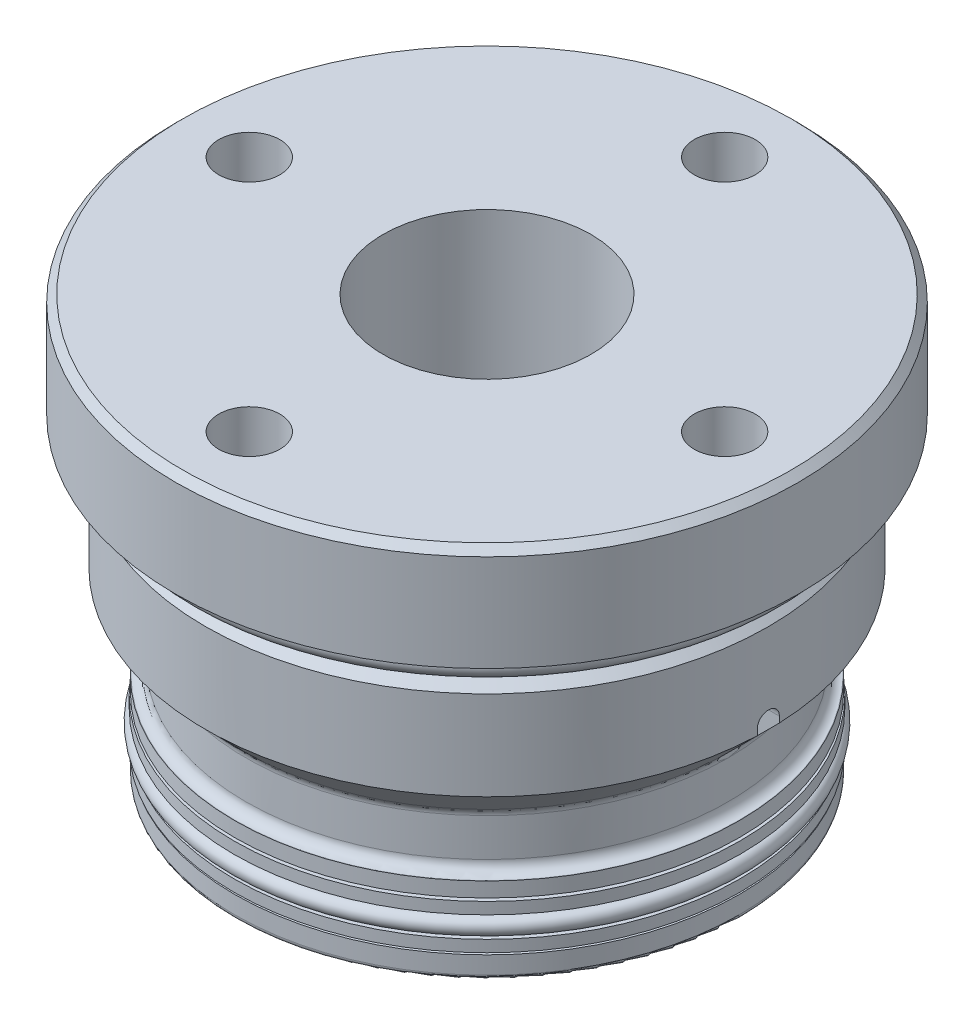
ISO-10303-21;
HEADER;
FILE_DESCRIPTION(('STEP AP214'),'2;1');
FILE_NAME('part.step','',(''),(''),'','','');
FILE_SCHEMA(('AUTOMOTIVE_DESIGN { 1 0 10303 214 1 1 1 1 }'));
ENDSEC;
DATA;
#1=APPLICATION_CONTEXT('core data for automotive mechanical design processes');
#2=APPLICATION_PROTOCOL_DEFINITION('international standard','automotive_design',2000,#1);
#3=PRODUCT_CONTEXT('',#1,'mechanical');
#4=PRODUCT('Part','Part','',(#3));
#5=PRODUCT_RELATED_PRODUCT_CATEGORY('part','',(#4));
#6=PRODUCT_DEFINITION_FORMATION('','',#4);
#7=PRODUCT_DEFINITION_CONTEXT('part definition',#1,'design');
#8=PRODUCT_DEFINITION('design','',#6,#7);
#9=PRODUCT_DEFINITION_SHAPE('','',#8);
#10=(LENGTH_UNIT() NAMED_UNIT(*) SI_UNIT(.MILLI.,.METRE.));
#11=(NAMED_UNIT(*) PLANE_ANGLE_UNIT() SI_UNIT($,.RADIAN.));
#12=(NAMED_UNIT(*) SI_UNIT($,.STERADIAN.) SOLID_ANGLE_UNIT());
#13=UNCERTAINTY_MEASURE_WITH_UNIT(LENGTH_MEASURE(1.E-05),#10,'distance_accuracy_value','');
#14=(GEOMETRIC_REPRESENTATION_CONTEXT(3) GLOBAL_UNCERTAINTY_ASSIGNED_CONTEXT((#13)) GLOBAL_UNIT_ASSIGNED_CONTEXT((#10,
#11,#12)) REPRESENTATION_CONTEXT('',''));
#15=CARTESIAN_POINT('',(0.,0.,0.));
#16=DIRECTION('',(0.,0.,1.));
#17=DIRECTION('',(1.,0.,0.));
#18=AXIS2_PLACEMENT_3D('',#15,#16,#17);
#19=CARTESIAN_POINT('',(0.,19.2278,0.));
#20=DIRECTION('',(0.,1.,0.));
#21=DIRECTION('',(0.,0.,1.));
#22=AXIS2_PLACEMENT_3D('',#19,#20,#21);
#23=CONICAL_SURFACE('',#22,30.0863,0.78539816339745);
#24=CARTESIAN_POINT('',(0.,19.2278,0.));
#25=DIRECTION('',(0.,-1.,0.));
#26=DIRECTION('',(0.,0.,-1.));
#27=AXIS2_PLACEMENT_3D('',#24,#25,#26);
#28=CIRCLE('',#27,30.0863);
#29=CARTESIAN_POINT('',(30.063107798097,19.2278,1.18110000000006));
#30=VERTEX_POINT('',#29);
#31=CARTESIAN_POINT('',(-30.063107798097,19.2278,1.18110000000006));
#32=VERTEX_POINT('',#31);
#33=EDGE_CURVE('E415',#30,#32,#28,.T.);
#34=ORIENTED_EDGE('',*,*,#33,.T.);
#35=CARTESIAN_POINT('',(-35.6457073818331,24.8067695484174,1.18110000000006));
#36=CARTESIAN_POINT('',(-34.3737350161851,23.535499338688,1.18110000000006));
#37=CARTESIAN_POINT('',(-33.1017299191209,22.2642618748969,1.18110000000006));
#38=CARTESIAN_POINT('',(-30.557613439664,19.7218933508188,1.18110000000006));
#39=CARTESIAN_POINT('',(-29.2855020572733,18.4507622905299,1.18110000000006));
#40=CARTESIAN_POINT('',(-26.7411321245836,15.9086474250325,1.18110000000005));
#41=CARTESIAN_POINT('',(-25.4688735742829,14.6376636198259,1.18110000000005));
#42=CARTESIAN_POINT('',(-22.9241121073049,12.0959406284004,1.18110000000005));
#43=CARTESIAN_POINT('',(-21.6516091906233,10.825201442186,1.18110000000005));
#44=CARTESIAN_POINT('',(-20.3789355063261,9.5546332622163,1.18110000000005));
#45=B_SPLINE_CURVE_WITH_KNOTS('',3,(#35,#36,#37,#38,#39,#40,#41,#42,#43,#44),.UNSPECIFIED.,.F.,
.F.,(4,2,2,2,4),(0.,5.39503242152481,10.7900647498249,16.1850971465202,21.5801296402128),.UNSPECIFIED.);
#46=CARTESIAN_POINT('',(-26.0636292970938,15.2318769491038,1.18110000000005));
#47=VERTEX_POINT('',#46);
#48=EDGE_CURVE('E311',#32,#47,#45,.T.);
#49=ORIENTED_EDGE('',*,*,#48,.T.);
#50=CARTESIAN_POINT('',(0.,15.2318769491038,0.));
#51=DIRECTION('',(0.,1.,0.));
#52=DIRECTION('',(0.,0.,1.));
#53=AXIS2_PLACEMENT_3D('',#50,#51,#52);
#54=CIRCLE('',#53,26.0903769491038);
#55=CARTESIAN_POINT('',(26.0636292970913,15.2318769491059,1.18110000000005));
#56=VERTEX_POINT('',#55);
#57=EDGE_CURVE('E442',#47,#56,#54,.T.);
#58=ORIENTED_EDGE('',*,*,#57,.T.);
#59=CARTESIAN_POINT('',(34.0628273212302,23.2247979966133,1.18110000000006));
#60=CARTESIAN_POINT('',(32.7908212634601,21.9535614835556,1.18110000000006));
#61=CARTESIAN_POINT('',(31.518778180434,20.6823620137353,1.18110000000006));
#62=CARTESIAN_POINT('',(28.9745679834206,18.1400872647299,1.18110000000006));
#63=CARTESIAN_POINT('',(27.7024008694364,16.8690119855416,1.18110000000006));
#64=CARTESIAN_POINT('',(25.1578925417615,14.327035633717,1.18110000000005));
#65=CARTESIAN_POINT('',(23.8855513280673,13.0561345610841,1.18110000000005));
#66=CARTESIAN_POINT('',(21.3405685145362,10.5146331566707,1.18110000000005));
#67=CARTESIAN_POINT('',(20.0679269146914,9.24403282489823,1.18110000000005));
#68=CARTESIAN_POINT('',(18.7950719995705,7.97364615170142,1.18110000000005));
#69=B_SPLINE_CURVE_WITH_KNOTS('',3,(#59,#60,#61,#62,#63,#64,#65,#66,#67,#68),.UNSPECIFIED.,.F.,
.F.,(4,2,2,2,4),(0.,5.3950324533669,10.7900647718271,16.1850971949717,21.580129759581),.UNSPECIFIED.);
#70=EDGE_CURVE('E292',#30,#56,#69,.T.);
#71=ORIENTED_EDGE('',*,*,#70,.F.);
#72=EDGE_LOOP('',(#34,#49,#58,#71));
#73=FACE_BOUND('',#72,.T.);
#74=ADVANCED_FACE('F33',(#73),#23,.T.);
#75=CARTESIAN_POINT('',(0.,14.4236538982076,0.));
#76=DIRECTION('',(0.,-1.,0.));
#77=DIRECTION('',(0.,0.,-1.));
#78=AXIS2_PLACEMENT_3D('',#75,#76,#77);
#79=TOROIDAL_SURFACE('',#78,26.8986,1.143);
#80=ORIENTED_EDGE('',*,*,#57,.F.);
#81=CARTESIAN_POINT('',(-26.0229969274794,15.1891369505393,1.18110000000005));
#82=CARTESIAN_POINT('',(-25.9799912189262,15.1414944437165,1.18110000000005));
#83=CARTESIAN_POINT('',(-25.9409748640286,15.0901882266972,1.18110000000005));
#84=CARTESIAN_POINT('',(-25.8720765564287,14.9817114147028,1.18110000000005));
#85=CARTESIAN_POINT('',(-25.8422055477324,14.9245339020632,1.18110000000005));
#86=CARTESIAN_POINT('',(-25.7925020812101,14.805993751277,1.18110000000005));
#87=CARTESIAN_POINT('',(-25.772665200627,14.7446329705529,1.18110000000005));
#88=CARTESIAN_POINT('',(-25.7435870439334,14.6194675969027,1.18110000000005));
#89=CARTESIAN_POINT('',(-25.7343431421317,14.5556636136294,1.18110000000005));
#90=CARTESIAN_POINT('',(-25.7267064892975,14.4274372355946,1.18110000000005));
#91=CARTESIAN_POINT('',(-25.7283089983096,14.3630151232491,1.18110000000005));
#92=CARTESIAN_POINT('',(-25.7423088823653,14.2353524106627,1.18110000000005));
#93=CARTESIAN_POINT('',(-25.7547066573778,14.1721118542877,1.18110000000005));
#94=CARTESIAN_POINT('',(-25.789940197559,14.0486204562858,1.18110000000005));
#95=CARTESIAN_POINT('',(-25.8127741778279,13.9883691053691,1.18110000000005));
#96=CARTESIAN_POINT('',(-25.8682280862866,13.8725523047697,1.18110000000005));
#97=CARTESIAN_POINT('',(-25.9008480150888,13.8169868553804,1.18110000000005));
#98=CARTESIAN_POINT('',(-25.9749648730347,13.7120858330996,1.18110000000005));
#99=CARTESIAN_POINT('',(-26.0164665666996,13.6627536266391,1.18110000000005));
#100=CARTESIAN_POINT('',(-26.1071558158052,13.571748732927,1.18110000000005));
#101=CARTESIAN_POINT('',(-26.1563433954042,13.5300760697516,1.18110000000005));
#102=CARTESIAN_POINT('',(-26.2610584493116,13.4555303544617,1.18110000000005));
#103=CARTESIAN_POINT('',(-26.3165919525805,13.4226657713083,1.18110000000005));
#104=CARTESIAN_POINT('',(-26.4323844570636,13.3667163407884,1.18110000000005));
#105=CARTESIAN_POINT('',(-26.4926434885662,13.3436315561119,1.18110000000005));
#106=CARTESIAN_POINT('',(-26.6162360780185,13.3078761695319,1.18110000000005));
#107=CARTESIAN_POINT('',(-26.6795724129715,13.2952151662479,1.18110000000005));
#108=CARTESIAN_POINT('',(-26.8074716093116,13.2807005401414,1.18110000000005));
#109=CARTESIAN_POINT('',(-26.8720344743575,13.2788469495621,1.18110000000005));
#110=CARTESIAN_POINT('',(-27.0005862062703,13.2860016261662,1.18110000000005));
#111=CARTESIAN_POINT('',(-27.0645747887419,13.2950150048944,1.18110000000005));
#112=CARTESIAN_POINT('',(-27.1901301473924,13.3236582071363,1.18110000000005));
#113=CARTESIAN_POINT('',(-27.2516969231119,13.3432880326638,1.18110000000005));
#114=CARTESIAN_POINT('',(-27.3706495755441,13.3926058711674,1.18110000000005));
#115=CARTESIAN_POINT('',(-27.4280361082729,13.4222923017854,1.18110000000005));
#116=CARTESIAN_POINT('',(-27.537006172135,13.4908844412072,1.18110000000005));
#117=CARTESIAN_POINT('',(-27.5885897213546,13.529790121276,1.18110000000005));
#118=CARTESIAN_POINT('',(-27.6844512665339,13.6156889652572,1.18110000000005));
#119=CARTESIAN_POINT('',(-27.728734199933,13.6626766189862,1.18110000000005));
#120=CARTESIAN_POINT('',(-27.8087744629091,13.7634252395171,1.18110000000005));
#121=CARTESIAN_POINT('',(-27.8445318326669,13.8171861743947,1.18110000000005));
#122=CARTESIAN_POINT('',(-27.9064723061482,13.9299038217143,1.18110000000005));
#123=CARTESIAN_POINT('',(-27.9326639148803,13.9888558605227,1.18110000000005));
#124=CARTESIAN_POINT('',(-27.9747698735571,14.1103224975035,1.18110000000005));
#125=CARTESIAN_POINT('',(-27.9906842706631,14.1728370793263,1.18110000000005));
#126=CARTESIAN_POINT('',(-28.0117734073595,14.2996048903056,1.18110000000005));
#127=CARTESIAN_POINT('',(-28.0169560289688,14.3638568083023,1.18110000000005));
#128=CARTESIAN_POINT('',(-28.016457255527,14.4923184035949,1.18110000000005));
#129=CARTESIAN_POINT('',(-28.0107758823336,14.5565280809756,1.18110000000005));
#130=CARTESIAN_POINT('',(-27.9887145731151,14.6830630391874,1.18110000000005));
#131=CARTESIAN_POINT('',(-27.9723377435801,14.7453888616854,1.18110000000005));
#132=CARTESIAN_POINT('',(-27.929355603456,14.8664074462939,1.18110000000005));
#133=CARTESIAN_POINT('',(-27.9027502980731,14.9251002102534,1.18110000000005));
#134=CARTESIAN_POINT('',(-27.8400608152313,15.0372042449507,1.18110000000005));
#135=CARTESIAN_POINT('',(-27.8039741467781,15.0906141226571,1.18110000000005));
#136=CARTESIAN_POINT('',(-27.7233521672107,15.1906230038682,1.18110000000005));
#137=CARTESIAN_POINT('',(-27.6788168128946,15.2372219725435,1.18110000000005));
#138=CARTESIAN_POINT('',(-27.5825283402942,15.3223224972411,1.18110000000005));
#139=CARTESIAN_POINT('',(-27.530770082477,15.3608182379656,1.18110000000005));
#140=CARTESIAN_POINT('',(-27.4215299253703,15.4285830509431,1.18110000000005));
#141=CARTESIAN_POINT('',(-27.3640479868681,15.4578520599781,1.18110000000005));
#142=CARTESIAN_POINT('',(-27.2449362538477,15.5063602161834,1.18110000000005));
#143=CARTESIAN_POINT('',(-27.1833027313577,15.5255902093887,1.18110000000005));
#144=CARTESIAN_POINT('',(-27.0576854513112,15.5534371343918,1.18110000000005));
#145=CARTESIAN_POINT('',(-26.9937017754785,15.5620544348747,1.18110000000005));
#146=CARTESIAN_POINT('',(-26.8651574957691,15.5684371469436,1.18110000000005));
#147=CARTESIAN_POINT('',(-26.8005965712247,15.5661960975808,1.18110000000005));
#148=CARTESIAN_POINT('',(-26.6727492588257,15.5509074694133,1.18110000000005));
#149=CARTESIAN_POINT('',(-26.6094631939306,15.5378571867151,1.18110000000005));
#150=CARTESIAN_POINT('',(-26.4859437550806,15.5013086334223,1.18110000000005));
#151=CARTESIAN_POINT('',(-26.425712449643,15.4778033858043,1.18110000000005));
#152=CARTESIAN_POINT('',(-26.3101083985,15.4210215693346,1.18110000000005));
#153=CARTESIAN_POINT('',(-26.2547298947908,15.3877567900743,1.18110000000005));
#154=CARTESIAN_POINT('',(-26.1699094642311,15.3265366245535,1.18110000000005));
#155=CARTESIAN_POINT('',(-26.138510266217,15.3012445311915,1.18110000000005));
#156=CARTESIAN_POINT('',(-26.0785492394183,15.2474949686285,1.18110000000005));
#157=CARTESIAN_POINT('',(-26.0499874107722,15.219037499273,1.18110000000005));
#158=CARTESIAN_POINT('',(-26.0229969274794,15.1891369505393,1.18110000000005));
#159=B_SPLINE_CURVE_WITH_KNOTS('',3,(#81,#82,#83,#84,#85,#86,#87,#88,#89,#90,#91,#92,#93,#94,
#95,#96,#97,#98,#99,#100,#101,#102,#103,#104,#105,#106,#107,#108,#109,#110,#111,#112,#113,#114,
#115,#116,#117,#118,#119,#120,#121,#122,#123,#124,#125,#126,#127,#128,#129,#130,#131,#132,#133,
#134,#135,#136,#137,#138,#139,#140,#141,#142,#143,#144,#145,#146,#147,#148,#149,#150,#151,#152,
#153,#154,#155,#156,#157,#158),.UNSPECIFIED.,.T.,.F.,(4,2,2,2,2,2,2,2,2,2,2,2,2,2,2,2,2,2,2,2,2,
2,2,2,2,2,2,2,2,2,2,2,2,2,2,2,2,2,4),(0.,0.19239845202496,0.385026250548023,0.577569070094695,
0.770064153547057,0.962475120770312,1.15489321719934,1.34727841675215,1.53966362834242,
1.73215230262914,1.92464158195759,2.11731528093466,2.3099902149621,2.50284237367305,
2.69569510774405,2.88863859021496,3.0815821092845,3.27449528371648,3.46740785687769,
3.66018942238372,3.85297007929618,4.04557891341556,4.23818686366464,4.43065330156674,
4.62311935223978,4.81552952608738,5.00793960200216,5.200400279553,5.39286194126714,
5.58546125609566,5.77806189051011,5.97083784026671,6.16360709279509,6.35649106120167,
6.54942329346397,6.74248447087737,6.93531338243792,7.05606309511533,7.17681281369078),.UNSPECIFIED.);
#160=CARTESIAN_POINT('',(-25.9505415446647,15.1003,1.18110000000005));
#161=VERTEX_POINT('',#160);
#162=EDGE_CURVE('E257',#47,#161,#159,.T.);
#163=ORIENTED_EDGE('',*,*,#162,.T.);
#164=CARTESIAN_POINT('',(-25.9506886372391,15.1005,1.18109998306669));
#165=CARTESIAN_POINT('',(-25.9361085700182,15.0806814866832,1.18110313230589));
#166=CARTESIAN_POINT('',(-25.9221896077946,15.0603860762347,1.18060710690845));
#167=CARTESIAN_POINT('',(-25.8957433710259,15.0189452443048,1.17847804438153));
#168=CARTESIAN_POINT('',(-25.8832171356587,14.9977992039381,1.17684416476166));
#169=CARTESIAN_POINT('',(-25.8484721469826,14.934397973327,1.17014583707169));
#170=CARTESIAN_POINT('',(-25.8283265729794,14.891141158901,1.16329748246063));
#171=CARTESIAN_POINT('',(-25.798727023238,14.8151942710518,1.14664494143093));
#172=CARTESIAN_POINT('',(-25.7878545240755,14.7827612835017,1.13811535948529));
#173=CARTESIAN_POINT('',(-25.7691931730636,14.7173121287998,1.11782173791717));
#174=CARTESIAN_POINT('',(-25.7614651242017,14.6842962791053,1.1060007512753));
#175=CARTESIAN_POINT('',(-25.755400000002,14.6516144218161,1.09255593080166));
#176=B_SPLINE_CURVE_WITH_KNOTS('',3,(#164,#165,#166,#167,#168,#169,#170,#171,#172,#173,#174,
#175),.UNSPECIFIED.,.F.,.F.,(4,2,2,2,2,4),(0.,0.073774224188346,0.147603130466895,
0.291444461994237,0.396941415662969,0.504391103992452),.UNSPECIFIED.);
#177=CARTESIAN_POINT('',(-25.7556,14.6526850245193,1.09299498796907));
#178=VERTEX_POINT('',#177);
#179=EDGE_CURVE('E158',#161,#178,#176,.T.);
#180=ORIENTED_EDGE('',*,*,#179,.T.);
#181=CARTESIAN_POINT('',(-25.7556,14.4236538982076,0.));
#182=CARTESIAN_POINT('',(-25.7556,14.4258593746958,0.0104692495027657));
#183=CARTESIAN_POINT('',(-25.7556,14.4280648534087,0.0209384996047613));
#184=CARTESIAN_POINT('',(-25.7556,14.5088143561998,0.404255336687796));
#185=CARTESIAN_POINT('',(-25.7556,14.5873257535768,0.777111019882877));
#186=CARTESIAN_POINT('',(-25.7556,14.7031418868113,1.33676538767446));
#187=CARTESIAN_POINT('',(-25.7556,14.7414187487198,1.52336184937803));
#188=CARTESIAN_POINT('',(-25.7556,14.8169993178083,1.89677327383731));
#189=CARTESIAN_POINT('',(-25.7556,14.854302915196,2.08358825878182));
#190=CARTESIAN_POINT('',(-25.7556,14.9774469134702,2.7117656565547));
#191=CARTESIAN_POINT('',(-25.7556,15.0602892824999,3.15372519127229));
#192=CARTESIAN_POINT('',(-25.7556,15.2137060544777,4.0396617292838));
#193=CARTESIAN_POINT('',(-25.7556,15.2842852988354,4.48363786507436));
#194=CARTESIAN_POINT('',(-25.7556,15.3763522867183,5.15216196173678));
#195=CARTESIAN_POINT('',(-25.7556,15.4047716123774,5.37575079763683));
#196=CARTESIAN_POINT('',(-25.7556,15.4559301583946,5.82355516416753));
#197=CARTESIAN_POINT('',(-25.7556,15.4786701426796,6.04777060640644));
#198=CARTESIAN_POINT('',(-25.7556,15.5172994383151,6.49717658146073));
#199=CARTESIAN_POINT('',(-25.7556,15.533177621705,6.72236810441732));
#200=CARTESIAN_POINT('',(-25.7556,15.5506425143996,7.06053424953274));
#201=CARTESIAN_POINT('',(-25.7556,15.5554057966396,7.17334667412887));
#202=CARTESIAN_POINT('',(-25.7556,15.5625580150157,7.39905690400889));
#203=CARTESIAN_POINT('',(-25.7556,15.5649467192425,7.51195471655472));
#204=CARTESIAN_POINT('',(-25.7556,15.5660206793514,7.62487275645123));
#205=B_SPLINE_CURVE_WITH_KNOTS('',3,(#181,#182,#183,#184,#185,#186,#187,#188,#189,#190,#191,
#192,#193,#194,#195,#196,#197,#198,#199,#200,#201,#202,#203,#204),.UNSPECIFIED.,.F.,.F.,(4,2,2,
2,2,2,2,2,2,2,2,4),(0.,0.0320971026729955,1.1751894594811,1.74663284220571,2.31814041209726,
3.66702082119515,5.01536748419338,5.69147273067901,6.3674869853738,7.04459347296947,
7.38331001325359,7.72205963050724),.UNSPECIFIED.);
#206=CARTESIAN_POINT('',(-25.7556,14.4236538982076,0.));
#207=VERTEX_POINT('',#206);
#208=EDGE_CURVE('E166',#207,#178,#205,.T.);
#209=ORIENTED_EDGE('',*,*,#208,.F.);
#210=CARTESIAN_POINT('',(0.,14.4236538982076,0.));
#211=DIRECTION('',(0.,-1.,0.));
#212=DIRECTION('',(0.,0.,-1.));
#213=AXIS2_PLACEMENT_3D('',#210,#211,#212);
#214=CIRCLE('',#213,25.7556);
#215=CARTESIAN_POINT('',(25.7556,14.4236538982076,0.));
#216=VERTEX_POINT('',#215);
#217=EDGE_CURVE('E439',#216,#207,#214,.T.);
#218=ORIENTED_EDGE('',*,*,#217,.F.);
#219=CARTESIAN_POINT('',(25.7556,14.4236538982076,0.));
#220=CARTESIAN_POINT('',(25.7556,14.4258593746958,0.0104692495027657));
#221=CARTESIAN_POINT('',(25.7556,14.4280648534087,0.0209384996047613));
#222=CARTESIAN_POINT('',(25.7556,14.5088143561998,0.404255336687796));
#223=CARTESIAN_POINT('',(25.7556,14.5873257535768,0.777111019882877));
#224=CARTESIAN_POINT('',(25.7556,14.7031418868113,1.33676538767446));
#225=CARTESIAN_POINT('',(25.7556,14.7414187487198,1.52336184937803));
#226=CARTESIAN_POINT('',(25.7556,14.8169993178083,1.89677327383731));
#227=CARTESIAN_POINT('',(25.7556,14.854302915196,2.08358825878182));
#228=CARTESIAN_POINT('',(25.7556,14.9774469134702,2.7117656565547));
#229=CARTESIAN_POINT('',(25.7556,15.0602892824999,3.15372519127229));
#230=CARTESIAN_POINT('',(25.7556,15.2137060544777,4.0396617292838));
#231=CARTESIAN_POINT('',(25.7556,15.2842852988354,4.48363786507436));
#232=CARTESIAN_POINT('',(25.7556,15.3763522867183,5.15216196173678));
#233=CARTESIAN_POINT('',(25.7556,15.4047716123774,5.37575079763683));
#234=CARTESIAN_POINT('',(25.7556,15.4559301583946,5.82355516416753));
#235=CARTESIAN_POINT('',(25.7556,15.4786701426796,6.04777060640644));
#236=CARTESIAN_POINT('',(25.7556,15.5172994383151,6.49717658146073));
#237=CARTESIAN_POINT('',(25.7556,15.533177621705,6.72236810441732));
#238=CARTESIAN_POINT('',(25.7556,15.5506425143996,7.06053424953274));
#239=CARTESIAN_POINT('',(25.7556,15.5554057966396,7.17334667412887));
#240=CARTESIAN_POINT('',(25.7556,15.5625580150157,7.39905690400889));
#241=CARTESIAN_POINT('',(25.7556,15.5649467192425,7.51195471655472));
#242=CARTESIAN_POINT('',(25.7556,15.5660206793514,7.62487275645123));
#243=B_SPLINE_CURVE_WITH_KNOTS('',3,(#219,#220,#221,#222,#223,#224,#225,#226,#227,#228,#229,
#230,#231,#232,#233,#234,#235,#236,#237,#238,#239,#240,#241,#242),.UNSPECIFIED.,.F.,.F.,(4,2,2,
2,2,2,2,2,2,2,2,4),(0.,0.0320971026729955,1.1751894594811,1.74663284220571,2.31814041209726,
3.66702082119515,5.01536748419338,5.69147273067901,6.3674869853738,7.04459347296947,
7.38331001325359,7.72205963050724),.UNSPECIFIED.);
#244=CARTESIAN_POINT('',(25.7556,14.6526850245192,1.09299498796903));
#245=VERTEX_POINT('',#244);
#246=EDGE_CURVE('E205',#245,#216,#243,.F.);
#247=ORIENTED_EDGE('',*,*,#246,.F.);
#248=CARTESIAN_POINT('',(25.9506886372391,15.1005,1.18109998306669));
#249=CARTESIAN_POINT('',(25.9361085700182,15.0806814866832,1.18110313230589));
#250=CARTESIAN_POINT('',(25.9221896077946,15.0603860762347,1.18060710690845));
#251=CARTESIAN_POINT('',(25.8957433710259,15.0189452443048,1.17847804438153));
#252=CARTESIAN_POINT('',(25.8832171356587,14.9977992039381,1.17684416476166));
#253=CARTESIAN_POINT('',(25.8484721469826,14.934397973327,1.17014583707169));
#254=CARTESIAN_POINT('',(25.8283265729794,14.891141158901,1.16329748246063));
#255=CARTESIAN_POINT('',(25.798727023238,14.8151942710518,1.14664494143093));
#256=CARTESIAN_POINT('',(25.7878545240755,14.7827612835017,1.13811535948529));
#257=CARTESIAN_POINT('',(25.7691931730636,14.7173121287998,1.11782173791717));
#258=CARTESIAN_POINT('',(25.7614651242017,14.6842962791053,1.1060007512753));
#259=CARTESIAN_POINT('',(25.755400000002,14.6516144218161,1.09255593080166));
#260=B_SPLINE_CURVE_WITH_KNOTS('',3,(#248,#249,#250,#251,#252,#253,#254,#255,#256,#257,#258,
#259),.UNSPECIFIED.,.F.,.F.,(4,2,2,2,2,4),(0.,0.073774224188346,0.147603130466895,
0.291444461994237,0.396941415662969,0.504391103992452),.UNSPECIFIED.);
#261=CARTESIAN_POINT('',(25.9505415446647,15.1003,1.18110000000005));
#262=VERTEX_POINT('',#261);
#263=EDGE_CURVE('E244',#262,#245,#260,.T.);
#264=ORIENTED_EDGE('',*,*,#263,.F.);
#265=CARTESIAN_POINT('',(25.9873195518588,15.1476632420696,1.18110000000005));
#266=CARTESIAN_POINT('',(25.9466467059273,15.0980238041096,1.18110000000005));
#267=CARTESIAN_POINT('',(25.9101335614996,15.0449159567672,1.18110000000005));
#268=CARTESIAN_POINT('',(25.8465108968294,14.9332800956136,1.18110000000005));
#269=CARTESIAN_POINT('',(25.8194126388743,14.8747456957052,1.18110000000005));
#270=CARTESIAN_POINT('',(25.7754422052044,14.7539774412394,1.18110000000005));
#271=CARTESIAN_POINT('',(25.7585654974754,14.6917452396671,1.18110000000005));
#272=CARTESIAN_POINT('',(25.7355106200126,14.5653470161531,1.18110000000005));
#273=CARTESIAN_POINT('',(25.7293298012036,14.5011814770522,1.18110000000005));
#274=CARTESIAN_POINT('',(25.7278340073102,14.3727483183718,1.18110000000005));
#275=CARTESIAN_POINT('',(25.732514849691,14.3084807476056,1.18110000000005));
#276=CARTESIAN_POINT('',(25.7526007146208,14.1816415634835,1.18110000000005));
#277=CARTESIAN_POINT('',(25.7680061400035,14.1190700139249,1.18110000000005));
#278=CARTESIAN_POINT('',(25.809100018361,13.9974050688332,1.18110000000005));
#279=CARTESIAN_POINT('',(25.8347877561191,13.9383114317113,1.18110000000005));
#280=CARTESIAN_POINT('',(25.8957136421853,13.8252719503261,1.18110000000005));
#281=CARTESIAN_POINT('',(25.9309517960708,13.771326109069,1.18110000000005));
#282=CARTESIAN_POINT('',(26.0100001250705,13.6700764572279,1.18110000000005));
#283=CARTESIAN_POINT('',(26.053815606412,13.6227767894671,1.18110000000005));
#284=CARTESIAN_POINT('',(26.1487585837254,13.5361959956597,1.18110000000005));
#285=CARTESIAN_POINT('',(26.199886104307,13.4969148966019,1.18110000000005));
#286=CARTESIAN_POINT('',(26.3080555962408,13.4274451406,1.18110000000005));
#287=CARTESIAN_POINT('',(26.3651033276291,13.3972654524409,1.18110000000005));
#288=CARTESIAN_POINT('',(26.4834526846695,13.3469021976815,1.18110000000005));
#289=CARTESIAN_POINT('',(26.5447543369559,13.3267186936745,1.18110000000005));
#290=CARTESIAN_POINT('',(26.669929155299,13.2969038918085,1.18110000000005));
#291=CARTESIAN_POINT('',(26.7338045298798,13.287281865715,1.18110000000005));
#292=CARTESIAN_POINT('',(26.862264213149,13.278893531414,1.18110000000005));
#293=CARTESIAN_POINT('',(26.9268485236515,13.2801272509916,1.18110000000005));
#294=CARTESIAN_POINT('',(27.0549189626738,13.2934187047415,1.18110000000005));
#295=CARTESIAN_POINT('',(27.1184046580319,13.3054806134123,1.18110000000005));
#296=CARTESIAN_POINT('',(27.242449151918,13.3400941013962,1.18110000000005));
#297=CARTESIAN_POINT('',(27.3030079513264,13.3626456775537,1.18110000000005));
#298=CARTESIAN_POINT('',(27.4194627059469,13.4175945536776,1.18110000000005));
#299=CARTESIAN_POINT('',(27.4753597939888,13.4499894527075,1.18110000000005));
#300=CARTESIAN_POINT('',(27.5809167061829,13.523710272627,1.18110000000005));
#301=CARTESIAN_POINT('',(27.6305765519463,13.5650361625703,1.18110000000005));
#302=CARTESIAN_POINT('',(27.7222098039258,13.6554142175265,1.18110000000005));
#303=CARTESIAN_POINT('',(27.7641888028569,13.7044607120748,1.18110000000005));
#304=CARTESIAN_POINT('',(27.8393079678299,13.808910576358,1.18110000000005));
#305=CARTESIAN_POINT('',(27.8724481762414,13.8643139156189,1.18110000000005));
#306=CARTESIAN_POINT('',(27.9289181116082,13.9798516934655,1.18110000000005));
#307=CARTESIAN_POINT('',(27.9522565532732,14.0399818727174,1.18110000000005));
#308=CARTESIAN_POINT('',(27.9884993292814,14.1633085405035,1.18110000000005));
#309=CARTESIAN_POINT('',(28.0014037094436,14.2265050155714,1.18110000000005));
#310=CARTESIAN_POINT('',(28.016404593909,14.3541238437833,1.18110000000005));
#311=CARTESIAN_POINT('',(28.0185085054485,14.4185453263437,1.18110000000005));
#312=CARTESIAN_POINT('',(28.0118684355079,14.5468267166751,1.18110000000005));
#313=CARTESIAN_POINT('',(28.0031244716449,14.6106866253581,1.18110000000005));
#314=CARTESIAN_POINT('',(27.9750412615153,14.736018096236,1.18110000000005));
#315=CARTESIAN_POINT('',(27.9557042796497,14.7974901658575,1.18110000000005));
#316=CARTESIAN_POINT('',(27.90698790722,14.9163169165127,1.18110000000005));
#317=CARTESIAN_POINT('',(27.8776085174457,14.9736715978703,1.18110000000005));
#318=CARTESIAN_POINT('',(27.8096323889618,15.0826573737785,1.18110000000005));
#319=CARTESIAN_POINT('',(27.7710325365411,15.1342865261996,1.18110000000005));
#320=CARTESIAN_POINT('',(27.6857189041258,15.2303379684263,1.18110000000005));
#321=CARTESIAN_POINT('',(27.639005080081,15.2747602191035,1.18110000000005));
#322=CARTESIAN_POINT('',(27.5387521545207,15.3551734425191,1.18110000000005));
#323=CARTESIAN_POINT('',(27.4852078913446,15.3911579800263,1.18110000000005));
#324=CARTESIAN_POINT('',(27.3728421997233,15.4536363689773,1.18110000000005));
#325=CARTESIAN_POINT('',(27.3140207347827,15.48013015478,1.18110000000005));
#326=CARTESIAN_POINT('',(27.1927133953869,15.5228995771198,1.18110000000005));
#327=CARTESIAN_POINT('',(27.1302242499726,15.5391659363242,1.18110000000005));
#328=CARTESIAN_POINT('',(27.0034050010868,15.5609835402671,1.18110000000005));
#329=CARTESIAN_POINT('',(26.9390749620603,15.5665351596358,1.18110000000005));
#330=CARTESIAN_POINT('',(26.8103606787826,15.5667689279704,1.18110000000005));
#331=CARTESIAN_POINT('',(26.7459764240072,15.5614452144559,1.18110000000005));
#332=CARTESIAN_POINT('',(26.6189977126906,15.5400628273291,1.18110000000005));
#333=CARTESIAN_POINT('',(26.5564037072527,15.5240014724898,1.18110000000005));
#334=CARTESIAN_POINT('',(26.4347704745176,15.4815884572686,1.18110000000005));
#335=CARTESIAN_POINT('',(26.3757333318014,15.4552308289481,1.18110000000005));
#336=CARTESIAN_POINT('',(26.2629796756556,15.3929871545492,1.18110000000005));
#337=CARTESIAN_POINT('',(26.2092568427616,15.3571126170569,1.18110000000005));
#338=CARTESIAN_POINT('',(26.1274685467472,15.2919099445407,1.18110000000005));
#339=CARTESIAN_POINT('',(26.0973200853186,15.2651490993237,1.18110000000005));
#340=CARTESIAN_POINT('',(26.0400081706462,15.2086019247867,1.18110000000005));
#341=CARTESIAN_POINT('',(26.0128447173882,15.1788155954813,1.18110000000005));
#342=CARTESIAN_POINT('',(25.9873195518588,15.1476632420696,1.18110000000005));
#343=B_SPLINE_CURVE_WITH_KNOTS('',3,(#265,#266,#267,#268,#269,#270,#271,#272,#273,#274,#275,
#276,#277,#278,#279,#280,#281,#282,#283,#284,#285,#286,#287,#288,#289,#290,#291,#292,#293,#294,
#295,#296,#297,#298,#299,#300,#301,#302,#303,#304,#305,#306,#307,#308,#309,#310,#311,#312,#313,
#314,#315,#316,#317,#318,#319,#320,#321,#322,#323,#324,#325,#326,#327,#328,#329,#330,#331,#332,
#333,#334,#335,#336,#337,#338,#339,#340,#341,#342),.UNSPECIFIED.,.T.,.F.,(4,2,2,2,2,2,2,2,2,2,2,
2,2,2,2,2,2,2,2,2,2,2,2,2,2,2,2,2,2,2,2,2,2,2,2,2,2,2,4),(0.,0.192376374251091,
0.384982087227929,0.577502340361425,0.769974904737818,0.962373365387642,1.15477905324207,
1.34717136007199,1.53956377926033,1.73207559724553,1.92458806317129,2.11728962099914,
2.30999238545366,2.50286418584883,2.6957364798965,2.88868316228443,3.08162978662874,
3.27452938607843,3.46742831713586,3.66018622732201,3.85294321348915,4.04552845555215,
4.23811285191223,4.43056515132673,4.62301713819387,4.81542800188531,5.00783885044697,
5.20031476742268,5.39279172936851,5.58541501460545,5.77803963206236,5.97083872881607,
6.16363108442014,6.35652739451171,6.54947188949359,6.74252838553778,6.9353524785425,
7.0560826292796,7.17681277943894),.UNSPECIFIED.);
#344=EDGE_CURVE('E221',#56,#262,#343,.T.);
#345=ORIENTED_EDGE('',*,*,#344,.F.);
#346=EDGE_LOOP('',(#80,#163,#180,#209,#218,#247,#264,#345));
#347=FACE_BOUND('',#346,.T.);
#348=ADVANCED_FACE('F197',(#347),#79,.F.);
#349=CARTESIAN_POINT('',(0.,0.,0.));
#350=DIRECTION('',(0.,-1.,0.));
#351=DIRECTION('',(0.,0.,-1.));
#352=AXIS2_PLACEMENT_3D('',#349,#350,#351);
#353=CYLINDRICAL_SURFACE('',#352,30.0863);
#354=CARTESIAN_POINT('',(0.,28.7528,0.));
#355=DIRECTION('',(0.,-1.,0.));
#356=DIRECTION('',(0.,0.,-1.));
#357=AXIS2_PLACEMENT_3D('',#354,#355,#356);
#358=CIRCLE('',#357,30.0863);
#359=CARTESIAN_POINT('',(0.,28.7528,-30.0863));
#360=VERTEX_POINT('',#359);
#361=EDGE_CURVE('E486',#360,#360,#358,.T.);
#362=ORIENTED_EDGE('',*,*,#361,.T.);
#363=EDGE_LOOP('',(#362));
#364=FACE_BOUND('',#363,.T.);
#365=CARTESIAN_POINT('',(-30.0698133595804,19.2278,-0.995877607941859));
#366=CARTESIAN_POINT('',(-30.069221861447,19.2558037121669,-1.01373329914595));
#367=CARTESIAN_POINT('',(-30.0686541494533,19.2845477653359,-1.03039916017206));
#368=CARTESIAN_POINT('',(-30.0675810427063,19.3433358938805,-1.06125274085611));
#369=CARTESIAN_POINT('',(-30.0670756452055,19.3733799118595,-1.07544056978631));
#370=CARTESIAN_POINT('',(-30.0656764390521,19.4650980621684,-1.11410075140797));
#371=CARTESIAN_POINT('',(-30.0648976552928,19.5284479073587,-1.13472681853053));
#372=CARTESIAN_POINT('',(-30.0637377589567,19.6577126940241,-1.16505447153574));
#373=CARTESIAN_POINT('',(-30.0633568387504,19.7236288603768,-1.1747507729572));
#374=CARTESIAN_POINT('',(-30.0630355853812,19.8561495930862,-1.18294405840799));
#375=CARTESIAN_POINT('',(-30.0630951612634,19.9227540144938,-1.1814433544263));
#376=CARTESIAN_POINT('',(-30.0636480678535,20.0547376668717,-1.16728809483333));
#377=CARTESIAN_POINT('',(-30.064141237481,20.1201173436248,-1.1546376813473));
#378=CARTESIAN_POINT('',(-30.0655055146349,20.2478350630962,-1.11854779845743));
#379=CARTESIAN_POINT('',(-30.0663766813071,20.3101726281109,-1.09510664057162));
#380=CARTESIAN_POINT('',(-30.0683989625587,20.4300405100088,-1.03809494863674));
#381=CARTESIAN_POINT('',(-30.069550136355,20.4875698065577,-1.00452227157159));
#382=CARTESIAN_POINT('',(-30.0720025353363,20.5961744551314,-0.928204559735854));
#383=CARTESIAN_POINT('',(-30.0733037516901,20.6472501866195,-0.885460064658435));
#384=CARTESIAN_POINT('',(-30.0759107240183,20.7415395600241,-0.791975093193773));
#385=CARTESIAN_POINT('',(-30.0772164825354,20.7847476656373,-0.741229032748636));
#386=CARTESIAN_POINT('',(-30.0796845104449,20.862033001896,-0.633199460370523));
#387=CARTESIAN_POINT('',(-30.0808467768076,20.8961100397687,-0.575915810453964));
#388=CARTESIAN_POINT('',(-30.0828968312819,20.9541647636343,-0.456433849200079));
#389=CARTESIAN_POINT('',(-30.0837846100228,20.9781421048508,-0.394235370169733));
#390=CARTESIAN_POINT('',(-30.0851855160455,21.0153124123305,-0.266691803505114));
#391=CARTESIAN_POINT('',(-30.0856986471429,21.0285054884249,-0.20134674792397));
#392=CARTESIAN_POINT('',(-30.0862921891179,21.0437259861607,-0.0694106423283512));
#393=CARTESIAN_POINT('',(-30.0863728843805,21.0457607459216,-0.00282044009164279));
#394=CARTESIAN_POINT('',(-30.0860932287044,21.038626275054,0.129755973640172));
#395=CARTESIAN_POINT('',(-30.0857328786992,21.0294570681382,0.195742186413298));
#396=CARTESIAN_POINT('',(-30.0846119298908,21.0001812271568,0.32521498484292));
#397=CARTESIAN_POINT('',(-30.0838514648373,20.9800782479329,0.388702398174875));
#398=CARTESIAN_POINT('',(-30.0820159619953,20.9295092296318,0.511401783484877));
#399=CARTESIAN_POINT('',(-30.0809409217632,20.8990431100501,0.570613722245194));
#400=CARTESIAN_POINT('',(-30.078596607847,20.8285943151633,0.683114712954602));
#401=CARTESIAN_POINT('',(-30.0773272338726,20.7886067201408,0.736400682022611));
#402=CARTESIAN_POINT('',(-30.074737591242,20.7002575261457,0.835505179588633));
#403=CARTESIAN_POINT('',(-30.0734173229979,20.6518959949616,0.881323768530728));
#404=CARTESIAN_POINT('',(-30.0708738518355,20.5481391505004,0.964219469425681));
#405=CARTESIAN_POINT('',(-30.0696507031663,20.4927399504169,1.00129171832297));
#406=CARTESIAN_POINT('',(-30.0674402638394,20.3764981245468,1.06560953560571));
#407=CARTESIAN_POINT('',(-30.0664529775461,20.3156553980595,1.09285492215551));
#408=CARTESIAN_POINT('',(-30.0648260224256,20.1902729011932,1.13673620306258));
#409=CARTESIAN_POINT('',(-30.0641862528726,20.1257342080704,1.15337517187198));
#410=CARTESIAN_POINT('',(-30.0633262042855,19.9947738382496,1.17558091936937));
#411=CARTESIAN_POINT('',(-30.0631059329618,19.9283521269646,1.18114749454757));
#412=CARTESIAN_POINT('',(-30.063109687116,19.7955533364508,1.18105189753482));
#413=CARTESIAN_POINT('',(-30.0633335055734,19.7291762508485,1.17539495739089));
#414=CARTESIAN_POINT('',(-30.0641999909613,19.5983252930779,1.15301790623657));
#415=CARTESIAN_POINT('',(-30.0648424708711,19.533850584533,1.13630273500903));
#416=CARTESIAN_POINT('',(-30.0662133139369,19.4285612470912,1.09931192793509));
#417=CARTESIAN_POINT('',(-30.0668496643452,19.3867332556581,1.08185112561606));
#418=CARTESIAN_POINT('',(-30.0682468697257,19.3054098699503,1.04228533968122));
#419=CARTESIAN_POINT('',(-30.0690075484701,19.2659112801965,1.0201869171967));
#420=CARTESIAN_POINT('',(-30.0698133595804,19.2278,0.995877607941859));
#421=B_SPLINE_CURVE_WITH_KNOTS('',3,(#365,#366,#367,#368,#369,#370,#371,#372,#373,#374,#375,
#376,#377,#378,#379,#380,#381,#382,#383,#384,#385,#386,#387,#388,#389,#390,#391,#392,#393,#394,
#395,#396,#397,#398,#399,#400,#401,#402,#403,#404,#405,#406,#407,#408,#409,#410,#411,#412,#413,
#414,#415,#416,#417,#418,#419,#420),.UNSPECIFIED.,.F.,.F.,(4,2,2,2,2,2,2,2,2,2,2,2,2,2,2,2,2,2,
2,2,2,2,2,2,2,2,2,4),(0.,0.0995905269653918,0.199176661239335,0.398034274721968,
0.596987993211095,0.795900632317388,0.994739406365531,1.19360930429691,1.39252129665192,
1.59142158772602,1.79046130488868,1.98950522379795,2.18855593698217,2.38760462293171,
2.58652239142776,2.78543973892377,2.98429063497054,3.1831430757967,3.38209848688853,
3.58105228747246,3.78011644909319,3.97918429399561,4.17819440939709,4.37720818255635,
4.57612920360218,4.77496142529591,4.9106729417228,5.04619373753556),.UNSPECIFIED.);
#422=CARTESIAN_POINT('',(-30.063107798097,19.8628,-1.18110000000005));
#423=VERTEX_POINT('',#422);
#424=CARTESIAN_POINT('',(-30.063107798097,19.8628,1.18110000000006));
#425=VERTEX_POINT('',#424);
#426=EDGE_CURVE('E325',#423,#425,#421,.T.);
#427=ORIENTED_EDGE('',*,*,#426,.T.);
#428=DIRECTION('',(0.,-1.,0.));
#429=VECTOR('',#428,1.);
#430=CARTESIAN_POINT('',(-30.063107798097,0.,1.18110000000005));
#431=LINE('',#430,#429);
#432=EDGE_CURVE('E271',#425,#32,#431,.T.);
#433=ORIENTED_EDGE('',*,*,#432,.T.);
#434=ORIENTED_EDGE('',*,*,#33,.F.);
#435=DIRECTION('',(0.,-1.,0.));
#436=VECTOR('',#435,1.);
#437=CARTESIAN_POINT('',(30.063107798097,0.,1.18110000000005));
#438=LINE('',#437,#436);
#439=CARTESIAN_POINT('',(30.063107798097,19.8628,1.18110000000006));
#440=VERTEX_POINT('',#439);
#441=EDGE_CURVE('E298',#440,#30,#438,.T.);
#442=ORIENTED_EDGE('',*,*,#441,.F.);
#443=CARTESIAN_POINT('',(30.0698133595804,19.2278,0.995877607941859));
#444=CARTESIAN_POINT('',(30.069221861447,19.2558037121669,1.01373329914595));
#445=CARTESIAN_POINT('',(30.0686541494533,19.2845477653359,1.03039916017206));
#446=CARTESIAN_POINT('',(30.0675810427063,19.3433358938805,1.06125274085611));
#447=CARTESIAN_POINT('',(30.0670756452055,19.3733799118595,1.07544056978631));
#448=CARTESIAN_POINT('',(30.0656764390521,19.4650980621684,1.11410075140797));
#449=CARTESIAN_POINT('',(30.0648976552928,19.5284479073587,1.13472681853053));
#450=CARTESIAN_POINT('',(30.0637377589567,19.6577126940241,1.16505447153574));
#451=CARTESIAN_POINT('',(30.0633568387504,19.7236288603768,1.1747507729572));
#452=CARTESIAN_POINT('',(30.0630355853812,19.8561495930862,1.18294405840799));
#453=CARTESIAN_POINT('',(30.0630951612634,19.9227540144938,1.1814433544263));
#454=CARTESIAN_POINT('',(30.0636480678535,20.0547376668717,1.16728809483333));
#455=CARTESIAN_POINT('',(30.064141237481,20.1201173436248,1.1546376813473));
#456=CARTESIAN_POINT('',(30.0655055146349,20.2478350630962,1.11854779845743));
#457=CARTESIAN_POINT('',(30.0663766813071,20.3101726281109,1.09510664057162));
#458=CARTESIAN_POINT('',(30.0683989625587,20.4300405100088,1.03809494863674));
#459=CARTESIAN_POINT('',(30.069550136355,20.4875698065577,1.00452227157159));
#460=CARTESIAN_POINT('',(30.0720025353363,20.5961744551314,0.928204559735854));
#461=CARTESIAN_POINT('',(30.0733037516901,20.6472501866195,0.885460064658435));
#462=CARTESIAN_POINT('',(30.0759107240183,20.7415395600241,0.791975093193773));
#463=CARTESIAN_POINT('',(30.0772164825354,20.7847476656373,0.741229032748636));
#464=CARTESIAN_POINT('',(30.0796845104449,20.862033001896,0.633199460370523));
#465=CARTESIAN_POINT('',(30.0808467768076,20.8961100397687,0.575915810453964));
#466=CARTESIAN_POINT('',(30.0828968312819,20.9541647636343,0.456433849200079));
#467=CARTESIAN_POINT('',(30.0837846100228,20.9781421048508,0.394235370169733));
#468=CARTESIAN_POINT('',(30.0851855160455,21.0153124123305,0.266691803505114));
#469=CARTESIAN_POINT('',(30.0856986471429,21.0285054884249,0.20134674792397));
#470=CARTESIAN_POINT('',(30.0862921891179,21.0437259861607,0.0694106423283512));
#471=CARTESIAN_POINT('',(30.0863728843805,21.0457607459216,0.00282044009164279));
#472=CARTESIAN_POINT('',(30.0860932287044,21.038626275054,-0.129755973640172));
#473=CARTESIAN_POINT('',(30.0857328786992,21.0294570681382,-0.195742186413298));
#474=CARTESIAN_POINT('',(30.0846119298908,21.0001812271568,-0.32521498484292));
#475=CARTESIAN_POINT('',(30.0838514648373,20.9800782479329,-0.388702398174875));
#476=CARTESIAN_POINT('',(30.0820159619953,20.9295092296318,-0.511401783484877));
#477=CARTESIAN_POINT('',(30.0809409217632,20.8990431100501,-0.570613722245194));
#478=CARTESIAN_POINT('',(30.078596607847,20.8285943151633,-0.683114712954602));
#479=CARTESIAN_POINT('',(30.0773272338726,20.7886067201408,-0.736400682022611));
#480=CARTESIAN_POINT('',(30.074737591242,20.7002575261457,-0.835505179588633));
#481=CARTESIAN_POINT('',(30.0734173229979,20.6518959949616,-0.881323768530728));
#482=CARTESIAN_POINT('',(30.0708738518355,20.5481391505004,-0.964219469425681));
#483=CARTESIAN_POINT('',(30.0696507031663,20.4927399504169,-1.00129171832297));
#484=CARTESIAN_POINT('',(30.0674402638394,20.3764981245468,-1.06560953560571));
#485=CARTESIAN_POINT('',(30.0664529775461,20.3156553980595,-1.09285492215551));
#486=CARTESIAN_POINT('',(30.0648260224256,20.1902729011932,-1.13673620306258));
#487=CARTESIAN_POINT('',(30.0641862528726,20.1257342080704,-1.15337517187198));
#488=CARTESIAN_POINT('',(30.0633262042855,19.9947738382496,-1.17558091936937));
#489=CARTESIAN_POINT('',(30.0631059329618,19.9283521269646,-1.18114749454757));
#490=CARTESIAN_POINT('',(30.063109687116,19.7955533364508,-1.18105189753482));
#491=CARTESIAN_POINT('',(30.0633335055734,19.7291762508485,-1.17539495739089));
#492=CARTESIAN_POINT('',(30.0641999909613,19.5983252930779,-1.15301790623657));
#493=CARTESIAN_POINT('',(30.0648424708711,19.533850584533,-1.13630273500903));
#494=CARTESIAN_POINT('',(30.0662133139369,19.4285612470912,-1.09931192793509));
#495=CARTESIAN_POINT('',(30.0668496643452,19.3867332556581,-1.08185112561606));
#496=CARTESIAN_POINT('',(30.0682468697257,19.3054098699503,-1.04228533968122));
#497=CARTESIAN_POINT('',(30.0690075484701,19.2659112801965,-1.0201869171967));
#498=CARTESIAN_POINT('',(30.0698133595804,19.2278,-0.995877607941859));
#499=B_SPLINE_CURVE_WITH_KNOTS('',3,(#443,#444,#445,#446,#447,#448,#449,#450,#451,#452,#453,
#454,#455,#456,#457,#458,#459,#460,#461,#462,#463,#464,#465,#466,#467,#468,#469,#470,#471,#472,
#473,#474,#475,#476,#477,#478,#479,#480,#481,#482,#483,#484,#485,#486,#487,#488,#489,#490,#491,
#492,#493,#494,#495,#496,#497,#498),.UNSPECIFIED.,.F.,.F.,(4,2,2,2,2,2,2,2,2,2,2,2,2,2,2,2,2,2,
2,2,2,2,2,2,2,2,2,4),(0.,0.0995905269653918,0.199176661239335,0.398034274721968,
0.596987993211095,0.795900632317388,0.994739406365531,1.19360930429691,1.39252129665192,
1.59142158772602,1.79046130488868,1.98950522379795,2.18855593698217,2.38760462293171,
2.58652239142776,2.78543973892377,2.98429063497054,3.1831430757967,3.38209848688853,
3.58105228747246,3.78011644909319,3.97918429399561,4.17819440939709,4.37720818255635,
4.57612920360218,4.77496142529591,4.9106729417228,5.04619373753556),.UNSPECIFIED.);
#500=CARTESIAN_POINT('',(30.063107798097,19.8628,-1.18110000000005));
#501=VERTEX_POINT('',#500);
#502=EDGE_CURVE('E332',#440,#501,#499,.T.);
#503=ORIENTED_EDGE('',*,*,#502,.T.);
#504=DIRECTION('',(0.,-1.,0.));
#505=VECTOR('',#504,1.);
#506=CARTESIAN_POINT('',(30.063107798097,0.,-1.18110000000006));
#507=LINE('',#506,#505);
#508=CARTESIAN_POINT('',(30.063107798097,19.2278,-1.18110000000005));
#509=VERTEX_POINT('',#508);
#510=EDGE_CURVE('E322',#509,#501,#507,.F.);
#511=ORIENTED_EDGE('',*,*,#510,.F.);
#512=CARTESIAN_POINT('',(-30.063107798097,19.2278,-1.18110000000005));
#513=VERTEX_POINT('',#512);
#514=EDGE_CURVE('E421',#513,#509,#28,.T.);
#515=ORIENTED_EDGE('',*,*,#514,.F.);
#516=DIRECTION('',(0.,-1.,0.));
#517=VECTOR('',#516,1.);
#518=CARTESIAN_POINT('',(-30.063107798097,0.,-1.18110000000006));
#519=LINE('',#518,#517);
#520=EDGE_CURVE('E529',#513,#423,#519,.F.);
#521=ORIENTED_EDGE('',*,*,#520,.T.);
#522=EDGE_LOOP('',(#427,#433,#434,#442,#503,#511,#515,#521));
#523=FACE_BOUND('',#522,.T.);
#524=ADVANCED_FACE('F303',(#364,#523),#353,.T.);
#525=CARTESIAN_POINT('',(26.0636292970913,15.2318769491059,-1.18110000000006));
#526=VERTEX_POINT('',#525);
#527=CARTESIAN_POINT('',(-26.0636292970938,15.2318769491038,-1.18110000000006));
#528=VERTEX_POINT('',#527);
#529=EDGE_CURVE('E443',#526,#528,#54,.T.);
#530=ORIENTED_EDGE('',*,*,#529,.T.);
#531=CARTESIAN_POINT('',(-20.3789355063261,9.5546332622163,-1.18110000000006));
#532=CARTESIAN_POINT('',(-21.6516091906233,10.825201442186,-1.18110000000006));
#533=CARTESIAN_POINT('',(-22.9241121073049,12.0959406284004,-1.18110000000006));
#534=CARTESIAN_POINT('',(-25.4688735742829,14.6376636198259,-1.18110000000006));
#535=CARTESIAN_POINT('',(-26.7411321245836,15.9086474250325,-1.18110000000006));
#536=CARTESIAN_POINT('',(-29.2855020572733,18.4507622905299,-1.18110000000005));
#537=CARTESIAN_POINT('',(-30.557613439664,19.7218933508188,-1.18110000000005));
#538=CARTESIAN_POINT('',(-33.1017299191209,22.2642618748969,-1.18110000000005));
#539=CARTESIAN_POINT('',(-34.3737350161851,23.535499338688,-1.18110000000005));
#540=CARTESIAN_POINT('',(-35.6457073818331,24.8067695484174,-1.18110000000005));
#541=B_SPLINE_CURVE_WITH_KNOTS('',3,(#531,#532,#533,#534,#535,#536,#537,#538,#539,#540),
.UNSPECIFIED.,.F.,.F.,(4,2,2,2,4),(0.,5.39503249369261,10.7900648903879,16.185097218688,
21.5801296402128),.UNSPECIFIED.);
#542=EDGE_CURVE('E535',#528,#513,#541,.T.);
#543=ORIENTED_EDGE('',*,*,#542,.T.);
#544=ORIENTED_EDGE('',*,*,#514,.T.);
#545=CARTESIAN_POINT('',(18.7950719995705,7.97364615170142,-1.18110000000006));
#546=CARTESIAN_POINT('',(20.0679269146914,9.24403282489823,-1.18110000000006));
#547=CARTESIAN_POINT('',(21.3405685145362,10.5146331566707,-1.18110000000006));
#548=CARTESIAN_POINT('',(23.8855513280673,13.0561345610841,-1.18110000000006));
#549=CARTESIAN_POINT('',(25.1578925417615,14.327035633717,-1.18110000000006));
#550=CARTESIAN_POINT('',(27.7024008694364,16.8690119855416,-1.18110000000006));
#551=CARTESIAN_POINT('',(28.9745679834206,18.1400872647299,-1.18110000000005));
#552=CARTESIAN_POINT('',(31.518778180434,20.6823620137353,-1.18110000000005));
#553=CARTESIAN_POINT('',(32.7908212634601,21.9535614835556,-1.18110000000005));
#554=CARTESIAN_POINT('',(34.0628273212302,23.2247979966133,-1.18110000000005));
#555=B_SPLINE_CURVE_WITH_KNOTS('',3,(#545,#546,#547,#548,#549,#550,#551,#552,#553,#554),
.UNSPECIFIED.,.F.,.F.,(4,2,2,2,4),(0.,5.39503256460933,10.7900649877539,16.1850973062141,
21.580129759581),.UNSPECIFIED.);
#556=EDGE_CURVE('E316',#526,#509,#555,.T.);
#557=ORIENTED_EDGE('',*,*,#556,.F.);
#558=EDGE_LOOP('',(#530,#543,#544,#557));
#559=FACE_BOUND('',#558,.T.);
#560=ADVANCED_FACE('F195',(#559),#23,.T.);
#561=CARTESIAN_POINT('',(-25.755400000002,14.6516144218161,-1.09255593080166));
#562=CARTESIAN_POINT('',(-25.7595731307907,14.6740288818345,-1.10176410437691));
#563=CARTESIAN_POINT('',(-25.764511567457,14.6965958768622,-1.11022166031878));
#564=CARTESIAN_POINT('',(-25.7759649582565,14.7418380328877,-1.12564320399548));
#565=CARTESIAN_POINT('',(-25.7824798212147,14.7645131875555,-1.13260727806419));
#566=CARTESIAN_POINT('',(-25.8040887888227,14.8312666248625,-1.15095806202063));
#567=CARTESIAN_POINT('',(-25.8214553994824,14.87522434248,-1.16026558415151));
#568=CARTESIAN_POINT('',(-25.8566956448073,14.9496960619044,-1.17189678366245));
#569=CARTESIAN_POINT('',(-25.8732180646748,14.9806884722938,-1.17541698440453));
#570=CARTESIAN_POINT('',(-25.9095486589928,15.0416560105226,-1.18004777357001));
#571=CARTESIAN_POINT('',(-25.9294114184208,15.071602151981,-1.18111309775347));
#572=CARTESIAN_POINT('',(-25.9506886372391,15.1005,-1.18109998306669));
#573=B_SPLINE_CURVE_WITH_KNOTS('',3,(#561,#562,#563,#564,#565,#566,#567,#568,#569,#570,#571,
#572),.UNSPECIFIED.,.F.,.F.,(4,2,2,2,2,4),(0.,0.0737180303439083,0.147431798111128,
0.291136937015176,0.396800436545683,0.504397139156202),.UNSPECIFIED.);
#574=CARTESIAN_POINT('',(-25.7556,14.6526850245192,-1.09299498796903));
#575=VERTEX_POINT('',#574);
#576=CARTESIAN_POINT('',(-25.9505415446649,15.1003,-1.18110000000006));
#577=VERTEX_POINT('',#576);
#578=EDGE_CURVE('E264',#575,#577,#573,.T.);
#579=ORIENTED_EDGE('',*,*,#578,.T.);
#580=CARTESIAN_POINT('',(-26.0229969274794,15.1891369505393,-1.18110000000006));
#581=CARTESIAN_POINT('',(-26.0660688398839,15.2368442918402,-1.18110000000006));
#582=CARTESIAN_POINT('',(-26.1132041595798,15.2809465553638,-1.18110000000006));
#583=CARTESIAN_POINT('',(-26.2142516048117,15.3606454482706,-1.18110000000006));
#584=CARTESIAN_POINT('',(-26.2681719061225,15.3962316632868,-1.18110000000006));
#585=CARTESIAN_POINT('',(-26.3811984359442,15.4578317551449,-1.18110000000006));
#586=CARTESIAN_POINT('',(-26.4403019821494,15.4838505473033,-1.18110000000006));
#587=CARTESIAN_POINT('',(-26.5620204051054,15.5255948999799,-1.18110000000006));
#588=CARTESIAN_POINT('',(-26.6246344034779,15.541323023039,-1.18110000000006));
#589=CARTESIAN_POINT('',(-26.7516566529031,15.5620616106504,-1.18110000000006));
#590=CARTESIAN_POINT('',(-26.8160660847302,15.5670648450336,-1.18110000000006));
#591=CARTESIAN_POINT('',(-26.9448136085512,15.5661900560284,-1.18110000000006));
#592=CARTESIAN_POINT('',(-27.0091516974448,15.5603115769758,-1.18110000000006));
#593=CARTESIAN_POINT('',(-27.1359431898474,15.5378353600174,-1.18110000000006));
#594=CARTESIAN_POINT('',(-27.198396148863,15.5212351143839,-1.18110000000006));
#595=CARTESIAN_POINT('',(-27.3196269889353,15.4777815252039,-1.18110000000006));
#596=CARTESIAN_POINT('',(-27.3784048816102,15.4509282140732,-1.18110000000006));
#597=CARTESIAN_POINT('',(-27.4905930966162,15.3877394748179,-1.18110000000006));
#598=CARTESIAN_POINT('',(-27.5440053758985,15.3514075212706,-1.18110000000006));
#599=CARTESIAN_POINT('',(-27.6439658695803,15.2702855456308,-1.18110000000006));
#600=CARTESIAN_POINT('',(-27.6905141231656,15.2254955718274,-1.18110000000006));
#601=CARTESIAN_POINT('',(-27.7753852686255,15.1287666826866,-1.18110000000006));
#602=CARTESIAN_POINT('',(-27.8137146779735,15.0768334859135,-1.18110000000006));
#603=CARTESIAN_POINT('',(-27.8811016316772,14.9672645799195,-1.18110000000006));
#604=CARTESIAN_POINT('',(-27.9101592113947,14.9096288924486,-1.18110000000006));
#605=CARTESIAN_POINT('',(-27.9581513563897,14.790345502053,-1.18110000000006));
#606=CARTESIAN_POINT('',(-27.9770947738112,14.7287013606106,-1.18110000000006));
#607=CARTESIAN_POINT('',(-28.0043565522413,14.6031068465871,-1.18110000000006));
#608=CARTESIAN_POINT('',(-28.0126749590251,14.5391564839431,-1.18110000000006));
#609=CARTESIAN_POINT('',(-28.0184474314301,14.4108060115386,-1.18110000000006));
#610=CARTESIAN_POINT('',(-28.0159080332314,14.3464061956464,-1.18110000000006));
#611=CARTESIAN_POINT('',(-28.0000522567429,14.2189473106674,-1.18110000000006));
#612=CARTESIAN_POINT('',(-27.9867358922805,14.1558882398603,-1.18110000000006));
#613=CARTESIAN_POINT('',(-27.9497078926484,14.0329065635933,-1.18110000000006));
#614=CARTESIAN_POINT('',(-27.9259972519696,13.9729836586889,-1.18110000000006));
#615=CARTESIAN_POINT('',(-27.8688566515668,13.8579665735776,-1.18110000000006));
#616=CARTESIAN_POINT('',(-27.8354266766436,13.8028724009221,-1.18110000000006));
#617=CARTESIAN_POINT('',(-27.7597818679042,13.6990493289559,-1.18110000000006));
#618=CARTESIAN_POINT('',(-27.7175631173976,13.6503232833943,-1.18110000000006));
#619=CARTESIAN_POINT('',(-27.6255504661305,13.5606435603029,-1.18110000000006));
#620=CARTESIAN_POINT('',(-27.5757565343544,13.5196899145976,-1.18110000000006));
#621=CARTESIAN_POINT('',(-27.4699637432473,13.4466813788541,-1.18110000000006));
#622=CARTESIAN_POINT('',(-27.4139598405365,13.414633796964,-1.18110000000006));
#623=CARTESIAN_POINT('',(-27.2973700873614,13.3603863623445,-1.18110000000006));
#624=CARTESIAN_POINT('',(-27.2367842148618,13.3381865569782,-1.18110000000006));
#625=CARTESIAN_POINT('',(-27.1126940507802,13.3042454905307,-1.18110000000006));
#626=CARTESIAN_POINT('',(-27.0491872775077,13.2925133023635,-1.18110000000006));
#627=CARTESIAN_POINT('',(-26.9211054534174,13.2798708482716,-1.18110000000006));
#628=CARTESIAN_POINT('',(-26.8565303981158,13.2789606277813,-1.18110000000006));
#629=CARTESIAN_POINT('',(-26.7281075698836,13.287989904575,-1.18110000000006));
#630=CARTESIAN_POINT('',(-26.664260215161,13.2979353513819,-1.18110000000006));
#631=CARTESIAN_POINT('',(-26.5391414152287,13.3284043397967,-1.18110000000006));
#632=CARTESIAN_POINT('',(-26.4778699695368,13.3489278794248,-1.18110000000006));
#633=CARTESIAN_POINT('',(-26.3596455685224,13.3999722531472,-1.18110000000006));
#634=CARTESIAN_POINT('',(-26.3026924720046,13.4304927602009,-1.18110000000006));
#635=CARTESIAN_POINT('',(-26.194722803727,13.5006680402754,-1.18110000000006));
#636=CARTESIAN_POINT('',(-26.1437062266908,13.5403228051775,-1.18110000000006));
#637=CARTESIAN_POINT('',(-26.049094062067,13.6276150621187,-1.18110000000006));
#638=CARTESIAN_POINT('',(-26.0054937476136,13.6752474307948,-1.18110000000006));
#639=CARTESIAN_POINT('',(-25.9269181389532,13.7771622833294,-1.18110000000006));
#640=CARTESIAN_POINT('',(-25.8919428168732,13.8314447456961,-1.18110000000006));
#641=CARTESIAN_POINT('',(-25.8316461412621,13.9450627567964,-1.18110000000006));
#642=CARTESIAN_POINT('',(-25.8063155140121,14.0043933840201,-1.18110000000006));
#643=CARTESIAN_POINT('',(-25.7659855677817,14.1264652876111,-1.18110000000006));
#644=CARTESIAN_POINT('',(-25.7509857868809,14.1892064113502,-1.18110000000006));
#645=CARTESIAN_POINT('',(-25.7317541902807,14.3162544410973,-1.18110000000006));
#646=CARTESIAN_POINT('',(-25.7275118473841,14.3805597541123,-1.18110000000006));
#647=CARTESIAN_POINT('',(-25.729887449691,14.5089869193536,-1.18110000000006));
#648=CARTESIAN_POINT('',(-25.7365080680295,14.5731087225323,-1.18110000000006));
#649=CARTESIAN_POINT('',(-25.7604220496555,14.6993329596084,-1.18110000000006));
#650=CARTESIAN_POINT('',(-25.7777168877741,14.7614351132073,-1.18110000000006));
#651=CARTESIAN_POINT('',(-25.8224777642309,14.8818001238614,-1.18110000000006));
#652=CARTESIAN_POINT('',(-25.8499315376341,14.9400675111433,-1.18110000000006));
#653=CARTESIAN_POINT('',(-25.9020712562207,15.0302009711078,-1.18110000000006));
#654=CARTESIAN_POINT('',(-25.9239082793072,15.0637482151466,-1.18110000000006));
#655=CARTESIAN_POINT('',(-25.9709714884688,15.1283745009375,-1.18110000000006));
#656=CARTESIAN_POINT('',(-25.996197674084,15.1594535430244,-1.18110000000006));
#657=CARTESIAN_POINT('',(-26.0229969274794,15.1891369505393,-1.18110000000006));
#658=B_SPLINE_CURVE_WITH_KNOTS('',3,(#580,#581,#582,#583,#584,#585,#586,#587,#588,#589,#590,
#591,#592,#593,#594,#595,#596,#597,#598,#599,#600,#601,#602,#603,#604,#605,#606,#607,#608,#609,
#610,#611,#612,#613,#614,#615,#616,#617,#618,#619,#620,#621,#622,#623,#624,#625,#626,#627,#628,
#629,#630,#631,#632,#633,#634,#635,#636,#637,#638,#639,#640,#641,#642,#643,#644,#645,#646,#647,
#648,#649,#650,#651,#652,#653,#654,#655,#656,#657),.UNSPECIFIED.,.T.,.F.,(4,2,2,2,2,2,2,2,2,2,2,
2,2,2,2,2,2,2,2,2,2,2,2,2,2,2,2,2,2,2,2,2,2,2,2,2,2,2,4),(0.,0.192676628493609,
0.385587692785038,0.578399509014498,0.771163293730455,0.964056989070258,1.15695876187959,
1.34990566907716,1.54285196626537,1.73572763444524,1.92860220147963,2.12132325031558,
2.31404356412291,2.50659492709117,2.69914546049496,2.89158009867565,3.08401448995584,
3.27643047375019,3.46884675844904,3.66134897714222,3.85385198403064,4.04651249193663,
4.23917392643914,4.43200219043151,4.62483126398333,4.81776607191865,5.01070084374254,
5.20362930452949,5.39655759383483,5.58936245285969,5.78216668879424,5.97478506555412,
6.16739482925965,6.35981603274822,6.55228459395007,6.74477975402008,6.93704326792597,
7.05692627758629,7.17680927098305),.UNSPECIFIED.);
#659=EDGE_CURVE('E252',#577,#528,#658,.T.);
#660=ORIENTED_EDGE('',*,*,#659,.T.);
#661=ORIENTED_EDGE('',*,*,#529,.F.);
#662=CARTESIAN_POINT('',(25.9873195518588,15.1476632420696,-1.18110000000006));
#663=CARTESIAN_POINT('',(26.0280549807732,15.1973700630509,-1.18110000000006));
#664=CARTESIAN_POINT('',(26.0730211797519,15.2436706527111,-1.18110000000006));
#665=CARTESIAN_POINT('',(26.1701286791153,15.3281009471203,-1.18110000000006));
#666=CARTESIAN_POINT('',(26.2222786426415,15.3662206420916,-1.18110000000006));
#667=CARTESIAN_POINT('',(26.3322155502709,15.433147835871,-1.18110000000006));
#668=CARTESIAN_POINT('',(26.3899995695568,15.4619601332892,-1.18110000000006));
#669=CARTESIAN_POINT('',(26.5095665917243,15.5094729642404,-1.18110000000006));
#670=CARTESIAN_POINT('',(26.5713485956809,15.528176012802,-1.18110000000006));
#671=CARTESIAN_POINT('',(26.6972196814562,15.5549654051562,-1.18110000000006));
#672=CARTESIAN_POINT('',(26.7613103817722,15.5630441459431,-1.18110000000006));
#673=CARTESIAN_POINT('',(26.8899411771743,15.5683313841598,-1.18110000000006));
#674=CARTESIAN_POINT('',(26.9544812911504,15.5655394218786,-1.18110000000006));
#675=CARTESIAN_POINT('',(27.082198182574,15.5491599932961,-1.18110000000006));
#676=CARTESIAN_POINT('',(27.1453745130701,15.5355690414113,-1.18110000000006));
#677=CARTESIAN_POINT('',(27.2685475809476,15.4979706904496,-1.18110000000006));
#678=CARTESIAN_POINT('',(27.328544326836,15.4739633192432,-1.18110000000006));
#679=CARTESIAN_POINT('',(27.4436359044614,15.4162189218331,-1.18110000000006));
#680=CARTESIAN_POINT('',(27.4987321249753,15.3824846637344,-1.18110000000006));
#681=CARTESIAN_POINT('',(27.6024733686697,15.3062385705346,-1.18110000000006));
#682=CARTESIAN_POINT('',(27.6511184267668,15.2637267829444,-1.18110000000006));
#683=CARTESIAN_POINT('',(27.740536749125,15.1711660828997,-1.18110000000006));
#684=CARTESIAN_POINT('',(27.7813159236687,15.1211228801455,-1.18110000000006));
#685=CARTESIAN_POINT('',(27.8538850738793,15.0148953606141,-1.18110000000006));
#686=CARTESIAN_POINT('',(27.8856750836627,14.9587110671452,-1.18110000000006));
#687=CARTESIAN_POINT('',(27.9393340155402,14.8418499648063,-1.18110000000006));
#688=CARTESIAN_POINT('',(27.9612117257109,14.7811771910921,-1.18110000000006));
#689=CARTESIAN_POINT('',(27.9944629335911,14.6570185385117,-1.18110000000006));
#690=CARTESIAN_POINT('',(28.0058364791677,14.5935326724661,-1.18110000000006));
#691=CARTESIAN_POINT('',(28.0177505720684,14.4655947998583,-1.18110000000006));
#692=CARTESIAN_POINT('',(28.0182982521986,14.401143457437,-1.18110000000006));
#693=CARTESIAN_POINT('',(28.0085632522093,14.2730640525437,-1.18110000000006));
#694=CARTESIAN_POINT('',(27.998280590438,14.2094359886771,-1.18110000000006));
#695=CARTESIAN_POINT('',(27.9671811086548,14.0848205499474,-1.18110000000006));
#696=CARTESIAN_POINT('',(27.9463661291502,14.0238327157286,-1.18110000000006));
#697=CARTESIAN_POINT('',(27.8947963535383,13.9062153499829,-1.18110000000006));
#698=CARTESIAN_POINT('',(27.8640415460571,13.8495858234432,-1.18110000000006));
#699=CARTESIAN_POINT('',(27.7934544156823,13.74226875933,-1.18110000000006));
#700=CARTESIAN_POINT('',(27.7536186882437,13.6915834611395,-1.18110000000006));
#701=CARTESIAN_POINT('',(27.6660093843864,13.5976135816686,-1.18110000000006));
#702=CARTESIAN_POINT('',(27.6182357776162,13.5543290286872,-1.18110000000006));
#703=CARTESIAN_POINT('',(27.5160673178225,13.4763526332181,-1.18110000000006));
#704=CARTESIAN_POINT('',(27.4616673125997,13.4416675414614,-1.18110000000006));
#705=CARTESIAN_POINT('',(27.3478203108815,13.3819132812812,-1.18110000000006));
#706=CARTESIAN_POINT('',(27.2883732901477,13.3568441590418,-1.18110000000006));
#707=CARTESIAN_POINT('',(27.1660635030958,13.317010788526,-1.18110000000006));
#708=CARTESIAN_POINT('',(27.1031977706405,13.3022556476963,-1.18110000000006));
#709=CARTESIAN_POINT('',(26.9758817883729,13.2835018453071,-1.18110000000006));
#710=CARTESIAN_POINT('',(26.9114315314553,13.2795032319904,-1.18110000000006));
#711=CARTESIAN_POINT('',(26.7827339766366,13.2823757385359,-1.18110000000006));
#712=CARTESIAN_POINT('',(26.7184868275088,13.2892535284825,-1.18110000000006));
#713=CARTESIAN_POINT('',(26.5920588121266,13.3136968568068,-1.18110000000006));
#714=CARTESIAN_POINT('',(26.5298779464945,13.3312623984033,-1.18110000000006));
#715=CARTESIAN_POINT('',(26.4093448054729,13.37658628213,-1.18110000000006));
#716=CARTESIAN_POINT('',(26.3509927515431,13.4043452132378,-1.18110000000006));
#717=CARTESIAN_POINT('',(26.2397805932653,13.4692708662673,-1.18110000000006));
#718=CARTESIAN_POINT('',(26.1869204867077,13.5064375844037,-1.18110000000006));
#719=CARTESIAN_POINT('',(26.0882260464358,13.589102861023,-1.18110000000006));
#720=CARTESIAN_POINT('',(26.0423877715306,13.6345967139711,-1.18110000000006));
#721=CARTESIAN_POINT('',(25.9590084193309,13.7326408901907,-1.18110000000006));
#722=CARTESIAN_POINT('',(25.9214673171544,13.7851911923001,-1.18110000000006));
#723=CARTESIAN_POINT('',(25.855786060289,13.89580368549,-1.18110000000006));
#724=CARTESIAN_POINT('',(25.8276371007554,13.9538606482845,-1.18110000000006));
#725=CARTESIAN_POINT('',(25.7814971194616,14.0738771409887,-1.18110000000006));
#726=CARTESIAN_POINT('',(25.763505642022,14.1358364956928,-1.18110000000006));
#727=CARTESIAN_POINT('',(25.7382063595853,14.2618327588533,-1.18110000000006));
#728=CARTESIAN_POINT('',(25.7308876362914,14.3258674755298,-1.18110000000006));
#729=CARTESIAN_POINT('',(25.7271089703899,14.4542739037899,-1.18110000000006));
#730=CARTESIAN_POINT('',(25.7306516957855,14.5186456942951,-1.18110000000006));
#731=CARTESIAN_POINT('',(25.7484961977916,14.6458768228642,-1.18110000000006));
#732=CARTESIAN_POINT('',(25.7627984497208,14.7087360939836,-1.18110000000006));
#733=CARTESIAN_POINT('',(25.8017473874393,14.8311061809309,-1.18110000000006));
#734=CARTESIAN_POINT('',(25.826381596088,14.8906209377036,-1.18110000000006));
#735=CARTESIAN_POINT('',(25.8741476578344,14.983142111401,-1.18110000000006));
#736=CARTESIAN_POINT('',(25.8943525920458,15.0176919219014,-1.18110000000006));
#737=CARTESIAN_POINT('',(25.938265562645,15.084488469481,-1.18110000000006));
#738=CARTESIAN_POINT('',(25.96197359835,15.1167352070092,-1.18110000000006));
#739=CARTESIAN_POINT('',(25.9873195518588,15.1476632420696,-1.18110000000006));
#740=B_SPLINE_CURVE_WITH_KNOTS('',3,(#662,#663,#664,#665,#666,#667,#668,#669,#670,#671,#672,
#673,#674,#675,#676,#677,#678,#679,#680,#681,#682,#683,#684,#685,#686,#687,#688,#689,#690,#691,
#692,#693,#694,#695,#696,#697,#698,#699,#700,#701,#702,#703,#704,#705,#706,#707,#708,#709,#710,
#711,#712,#713,#714,#715,#716,#717,#718,#719,#720,#721,#722,#723,#724,#725,#726,#727,#728,#729,
#730,#731,#732,#733,#734,#735,#736,#737,#738,#739),.UNSPECIFIED.,.T.,.F.,(4,2,2,2,2,2,2,2,2,2,2,
2,2,2,2,2,2,2,2,2,2,2,2,2,2,2,2,2,2,2,2,2,2,2,2,2,2,2,4),(0.,0.192652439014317,
0.385539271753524,0.578326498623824,0.771065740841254,0.963942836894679,1.15682808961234,
1.34977562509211,1.54272264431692,1.73561480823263,1.92850592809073,2.12125154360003,
2.31399642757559,2.50657009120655,2.69914287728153,2.89158877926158,3.08403435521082,
3.27644631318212,3.46885849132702,3.66134292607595,3.85382809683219,4.04646389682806,
4.23910062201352,4.43190723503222,4.6247147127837,4.81764047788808,5.01056630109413,
5.20350327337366,5.39644016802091,5.58926837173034,5.78209599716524,5.97474234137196,
6.16738004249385,6.3598205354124,6.55230830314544,6.74480457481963,6.93706904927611,
7.05693916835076,7.1768092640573),.UNSPECIFIED.);
#741=CARTESIAN_POINT('',(25.9505415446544,15.1003,-1.18110000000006));
#742=VERTEX_POINT('',#741);
#743=EDGE_CURVE('E228',#742,#526,#740,.T.);
#744=ORIENTED_EDGE('',*,*,#743,.F.);
#745=CARTESIAN_POINT('',(25.755400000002,14.6516144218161,-1.09255593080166));
#746=CARTESIAN_POINT('',(25.7595731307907,14.6740288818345,-1.10176410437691));
#747=CARTESIAN_POINT('',(25.764511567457,14.6965958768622,-1.11022166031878));
#748=CARTESIAN_POINT('',(25.7759649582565,14.7418380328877,-1.12564320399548));
#749=CARTESIAN_POINT('',(25.7824798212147,14.7645131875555,-1.13260727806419));
#750=CARTESIAN_POINT('',(25.8040887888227,14.8312666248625,-1.15095806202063));
#751=CARTESIAN_POINT('',(25.8214553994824,14.87522434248,-1.16026558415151));
#752=CARTESIAN_POINT('',(25.8566956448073,14.9496960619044,-1.17189678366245));
#753=CARTESIAN_POINT('',(25.8732180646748,14.9806884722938,-1.17541698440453));
#754=CARTESIAN_POINT('',(25.9095486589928,15.0416560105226,-1.18004777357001));
#755=CARTESIAN_POINT('',(25.9294114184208,15.071602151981,-1.18111309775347));
#756=CARTESIAN_POINT('',(25.9506886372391,15.1005,-1.18109998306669));
#757=B_SPLINE_CURVE_WITH_KNOTS('',3,(#745,#746,#747,#748,#749,#750,#751,#752,#753,#754,#755,
#756),.UNSPECIFIED.,.F.,.F.,(4,2,2,2,2,4),(0.,0.0737180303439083,0.147431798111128,
0.291136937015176,0.396800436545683,0.504397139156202),.UNSPECIFIED.);
#758=CARTESIAN_POINT('',(25.7556,14.6526850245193,-1.09299498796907));
#759=VERTEX_POINT('',#758);
#760=EDGE_CURVE('E236',#759,#742,#757,.T.);
#761=ORIENTED_EDGE('',*,*,#760,.F.);
#762=CARTESIAN_POINT('',(25.7556,14.4236538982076,0.));
#763=CARTESIAN_POINT('',(25.7556,14.4258593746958,-0.0104692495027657));
#764=CARTESIAN_POINT('',(25.7556,14.4280648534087,-0.0209384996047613));
#765=CARTESIAN_POINT('',(25.7556,14.5088143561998,-0.404255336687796));
#766=CARTESIAN_POINT('',(25.7556,14.5873257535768,-0.777111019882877));
#767=CARTESIAN_POINT('',(25.7556,14.7031418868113,-1.33676538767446));
#768=CARTESIAN_POINT('',(25.7556,14.7414187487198,-1.52336184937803));
#769=CARTESIAN_POINT('',(25.7556,14.8169993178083,-1.89677327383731));
#770=CARTESIAN_POINT('',(25.7556,14.854302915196,-2.08358825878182));
#771=CARTESIAN_POINT('',(25.7556,14.9774469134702,-2.7117656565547));
#772=CARTESIAN_POINT('',(25.7556,15.0602892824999,-3.15372519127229));
#773=CARTESIAN_POINT('',(25.7556,15.2137060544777,-4.0396617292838));
#774=CARTESIAN_POINT('',(25.7556,15.2842852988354,-4.48363786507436));
#775=CARTESIAN_POINT('',(25.7556,15.3763522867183,-5.15216196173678));
#776=CARTESIAN_POINT('',(25.7556,15.4047716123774,-5.37575079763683));
#777=CARTESIAN_POINT('',(25.7556,15.4559301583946,-5.82355516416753));
#778=CARTESIAN_POINT('',(25.7556,15.4786701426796,-6.04777060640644));
#779=CARTESIAN_POINT('',(25.7556,15.5172994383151,-6.49717658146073));
#780=CARTESIAN_POINT('',(25.7556,15.533177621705,-6.72236810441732));
#781=CARTESIAN_POINT('',(25.7556,15.5506425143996,-7.06053424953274));
#782=CARTESIAN_POINT('',(25.7556,15.5554057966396,-7.17334667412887));
#783=CARTESIAN_POINT('',(25.7556,15.5625580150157,-7.39905690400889));
#784=CARTESIAN_POINT('',(25.7556,15.5649467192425,-7.51195471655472));
#785=CARTESIAN_POINT('',(25.7556,15.5660206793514,-7.62487275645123));
#786=B_SPLINE_CURVE_WITH_KNOTS('',3,(#762,#763,#764,#765,#766,#767,#768,#769,#770,#771,#772,
#773,#774,#775,#776,#777,#778,#779,#780,#781,#782,#783,#784,#785),.UNSPECIFIED.,.F.,.F.,(4,2,2,
2,2,2,2,2,2,2,2,4),(0.,0.0320971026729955,1.1751894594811,1.74663284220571,2.31814041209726,
3.66702082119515,5.01536748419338,5.69147273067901,6.3674869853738,7.04459347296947,
7.38331001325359,7.72205963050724),.UNSPECIFIED.);
#787=EDGE_CURVE('E215',#216,#759,#786,.T.);
#788=ORIENTED_EDGE('',*,*,#787,.F.);
#789=EDGE_CURVE('E438',#207,#216,#214,.T.);
#790=ORIENTED_EDGE('',*,*,#789,.F.);
#791=CARTESIAN_POINT('',(-25.7556,14.4236538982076,0.));
#792=CARTESIAN_POINT('',(-25.7556,14.4258593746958,-0.0104692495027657));
#793=CARTESIAN_POINT('',(-25.7556,14.4280648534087,-0.0209384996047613));
#794=CARTESIAN_POINT('',(-25.7556,14.5088143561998,-0.404255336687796));
#795=CARTESIAN_POINT('',(-25.7556,14.5873257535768,-0.777111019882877));
#796=CARTESIAN_POINT('',(-25.7556,14.7031418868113,-1.33676538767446));
#797=CARTESIAN_POINT('',(-25.7556,14.7414187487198,-1.52336184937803));
#798=CARTESIAN_POINT('',(-25.7556,14.8169993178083,-1.89677327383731));
#799=CARTESIAN_POINT('',(-25.7556,14.854302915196,-2.08358825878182));
#800=CARTESIAN_POINT('',(-25.7556,14.9774469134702,-2.7117656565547));
#801=CARTESIAN_POINT('',(-25.7556,15.0602892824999,-3.15372519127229));
#802=CARTESIAN_POINT('',(-25.7556,15.2137060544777,-4.0396617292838));
#803=CARTESIAN_POINT('',(-25.7556,15.2842852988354,-4.48363786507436));
#804=CARTESIAN_POINT('',(-25.7556,15.3763522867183,-5.15216196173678));
#805=CARTESIAN_POINT('',(-25.7556,15.4047716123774,-5.37575079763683));
#806=CARTESIAN_POINT('',(-25.7556,15.4559301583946,-5.82355516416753));
#807=CARTESIAN_POINT('',(-25.7556,15.4786701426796,-6.04777060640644));
#808=CARTESIAN_POINT('',(-25.7556,15.5172994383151,-6.49717658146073));
#809=CARTESIAN_POINT('',(-25.7556,15.533177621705,-6.72236810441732));
#810=CARTESIAN_POINT('',(-25.7556,15.5506425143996,-7.06053424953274));
#811=CARTESIAN_POINT('',(-25.7556,15.5554057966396,-7.17334667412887));
#812=CARTESIAN_POINT('',(-25.7556,15.5625580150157,-7.39905690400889));
#813=CARTESIAN_POINT('',(-25.7556,15.5649467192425,-7.51195471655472));
#814=CARTESIAN_POINT('',(-25.7556,15.5660206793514,-7.62487275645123));
#815=B_SPLINE_CURVE_WITH_KNOTS('',3,(#791,#792,#793,#794,#795,#796,#797,#798,#799,#800,#801,
#802,#803,#804,#805,#806,#807,#808,#809,#810,#811,#812,#813,#814),.UNSPECIFIED.,.F.,.F.,(4,2,2,
2,2,2,2,2,2,2,2,4),(0.,0.0320971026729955,1.1751894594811,1.74663284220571,2.31814041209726,
3.66702082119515,5.01536748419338,5.69147273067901,6.3674869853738,7.04459347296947,
7.38331001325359,7.72205963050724),.UNSPECIFIED.);
#816=EDGE_CURVE('E161',#575,#207,#815,.F.);
#817=ORIENTED_EDGE('',*,*,#816,.F.);
#818=EDGE_LOOP('',(#579,#660,#661,#744,#761,#788,#790,#817));
#819=FACE_BOUND('',#818,.T.);
#820=ADVANCED_FACE('F189',(#819),#79,.F.);
#821=CARTESIAN_POINT('',(-33.274,19.8628,0.));
#822=DIRECTION('',(1.,0.,0.));
#823=DIRECTION('',(0.,0.,-1.));
#824=AXIS2_PLACEMENT_3D('',#821,#822,#823);
#825=CYLINDRICAL_SURFACE('',#824,1.1811);
#826=CARTESIAN_POINT('',(22.1935942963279,19.8628,-1.1811));
#827=CARTESIAN_POINT('',(22.1935947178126,19.9290926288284,-1.18109707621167));
#828=CARTESIAN_POINT('',(22.1938945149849,19.9954321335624,-1.17549995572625));
#829=CARTESIAN_POINT('',(22.1950615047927,20.1262806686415,-1.15325153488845));
#830=CARTESIAN_POINT('',(22.1959293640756,20.1907874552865,-1.13658724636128));
#831=CARTESIAN_POINT('',(22.198133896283,20.3160561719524,-1.09268331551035));
#832=CARTESIAN_POINT('',(22.1994703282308,20.3768200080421,-1.06544910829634));
#833=CARTESIAN_POINT('',(22.2024611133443,20.4928973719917,-1.00118686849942));
#834=CARTESIAN_POINT('',(22.2041153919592,20.5482121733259,-0.964161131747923));
#835=CARTESIAN_POINT('',(22.2075575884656,20.6518998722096,-0.881320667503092));
#836=CARTESIAN_POINT('',(22.209345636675,20.7002658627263,-0.835497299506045));
#837=CARTESIAN_POINT('',(22.2128526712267,20.7886240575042,-0.736379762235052));
#838=CARTESIAN_POINT('',(22.2145716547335,20.828615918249,-0.683085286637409));
#839=CARTESIAN_POINT('',(22.2177478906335,20.8991102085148,-0.570501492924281));
#840=CARTESIAN_POINT('',(22.2192049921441,20.9296071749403,-0.511208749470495));
#841=CARTESIAN_POINT('',(22.221691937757,20.9802109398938,-0.388335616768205));
#842=CARTESIAN_POINT('',(22.2227217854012,21.0003178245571,-0.324755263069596));
#843=CARTESIAN_POINT('',(22.2242372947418,21.0295521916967,-0.195176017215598));
#844=CARTESIAN_POINT('',(22.224723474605,21.0386901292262,-0.129179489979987));
#845=CARTESIAN_POINT('',(22.225098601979,21.0457594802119,0.00341240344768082));
#846=CARTESIAN_POINT('',(22.2249875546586,21.043690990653,0.0700077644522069));
#847=CARTESIAN_POINT('',(22.2241811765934,21.0284148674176,0.201836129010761));
#848=CARTESIAN_POINT('',(22.2234864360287,21.0152184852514,0.26707044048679));
#849=CARTESIAN_POINT('',(22.2215915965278,20.9780786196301,0.394396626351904));
#850=CARTESIAN_POINT('',(22.2203914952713,20.9541350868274,0.456488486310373));
#851=CARTESIAN_POINT('',(22.2176200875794,20.8961677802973,0.575803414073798));
#852=CARTESIAN_POINT('',(22.2160485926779,20.86213888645,0.633023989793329));
#853=CARTESIAN_POINT('',(22.2127113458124,20.7849705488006,0.740944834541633));
#854=CARTESIAN_POINT('',(22.2109455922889,20.7418310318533,0.791645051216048));
#855=CARTESIAN_POINT('',(22.2074160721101,20.6476024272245,0.885151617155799));
#856=CARTESIAN_POINT('',(22.2056523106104,20.596503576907,0.927948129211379));
#857=CARTESIAN_POINT('',(22.2023278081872,20.4878410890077,1.00435665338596));
#858=CARTESIAN_POINT('',(22.200767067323,20.4302774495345,1.03796866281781));
#859=CARTESIAN_POINT('',(22.1980247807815,20.3103133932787,1.09505323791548));
#860=CARTESIAN_POINT('',(22.1968432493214,20.2479127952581,1.11852542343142));
#861=CARTESIAN_POINT('',(22.1949931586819,20.1200488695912,1.1546574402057));
#862=CARTESIAN_POINT('',(22.194324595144,20.0545855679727,1.16731736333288));
#863=CARTESIAN_POINT('',(22.1935766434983,19.9225402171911,1.18145329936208));
#864=CARTESIAN_POINT('',(22.1934965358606,19.8559596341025,1.18294297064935));
#865=CARTESIAN_POINT('',(22.193932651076,19.7234943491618,1.17473176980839));
#866=CARTESIAN_POINT('',(22.1944488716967,19.6576096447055,1.16503093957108));
#867=CARTESIAN_POINT('',(22.1960188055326,19.5284447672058,1.13472543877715));
#868=CARTESIAN_POINT('',(22.1970722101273,19.4651631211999,1.11412702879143));
#869=CARTESIAN_POINT('',(22.1995975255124,19.3429552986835,1.06261741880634));
#870=CARTESIAN_POINT('',(22.2010694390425,19.2840291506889,1.0317061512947));
#871=CARTESIAN_POINT('',(22.204267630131,19.172142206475,0.960413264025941));
#872=CARTESIAN_POINT('',(22.2059941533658,19.1191872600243,0.92002247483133));
#873=CARTESIAN_POINT('',(22.2095061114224,19.0208047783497,0.830930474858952));
#874=CARTESIAN_POINT('',(22.2112915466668,18.9753772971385,0.782229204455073));
#875=CARTESIAN_POINT('',(22.2147222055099,18.8932933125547,0.677840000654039));
#876=CARTESIAN_POINT('',(22.2163672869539,18.8566456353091,0.622145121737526));
#877=CARTESIAN_POINT('',(22.2193298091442,18.7932219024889,0.505384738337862));
#878=CARTESIAN_POINT('',(22.2206472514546,18.7664457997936,0.444319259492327));
#879=CARTESIAN_POINT('',(22.2228053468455,18.7235407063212,0.318583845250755));
#880=CARTESIAN_POINT('',(22.2236462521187,18.7074060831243,0.253915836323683));
#881=CARTESIAN_POINT('',(22.2247575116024,18.6862235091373,0.122784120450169));
#882=CARTESIAN_POINT('',(22.2250278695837,18.6811754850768,0.0563204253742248));
#883=CARTESIAN_POINT('',(22.2249675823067,18.6823100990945,-0.0764284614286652));
#884=CARTESIAN_POINT('',(22.2246376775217,18.6884789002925,-0.142713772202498));
#885=CARTESIAN_POINT('',(22.2234154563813,18.7118434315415,-0.273306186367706));
#886=CARTESIAN_POINT('',(22.2225231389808,18.7290391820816,-0.337613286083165));
#887=CARTESIAN_POINT('',(22.22027646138,18.7739665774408,-0.462426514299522));
#888=CARTESIAN_POINT('',(22.2189220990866,18.8016982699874,-0.522932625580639));
#889=CARTESIAN_POINT('',(22.2159035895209,18.866908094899,-0.638431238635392));
#890=CARTESIAN_POINT('',(22.2142394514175,18.9043859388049,-0.693423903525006));
#891=CARTESIAN_POINT('',(22.2107862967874,18.9880742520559,-0.796404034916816));
#892=CARTESIAN_POINT('',(22.2089971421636,19.0342944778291,-0.844383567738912));
#893=CARTESIAN_POINT('',(22.2054965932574,19.1341470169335,-0.9319177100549));
#894=CARTESIAN_POINT('',(22.2037852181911,19.1877811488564,-0.971470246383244));
#895=CARTESIAN_POINT('',(22.2006319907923,19.3009855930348,-1.04104865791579));
#896=CARTESIAN_POINT('',(22.1991904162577,19.3605619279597,-1.07106473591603));
#897=CARTESIAN_POINT('',(22.1967436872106,19.4838719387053,-1.12063211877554));
#898=CARTESIAN_POINT('',(22.1957380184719,19.547600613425,-1.14019576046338));
#899=CARTESIAN_POINT('',(22.1945422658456,19.6535698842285,-1.16318209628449));
#900=CARTESIAN_POINT('',(22.1941883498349,19.6951244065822,-1.16989270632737));
#901=CARTESIAN_POINT('',(22.1937142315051,19.7787129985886,-1.17885258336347));
#902=CARTESIAN_POINT('',(22.1935940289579,19.8207470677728,-1.18110185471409));
#903=CARTESIAN_POINT('',(22.1935942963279,19.8628,-1.1811));
#904=B_SPLINE_CURVE_WITH_KNOTS('',3,(#826,#827,#828,#829,#830,#831,#832,#833,#834,#835,#836,
#837,#838,#839,#840,#841,#842,#843,#844,#845,#846,#847,#848,#849,#850,#851,#852,#853,#854,#855,
#856,#857,#858,#859,#860,#861,#862,#863,#864,#865,#866,#867,#868,#869,#870,#871,#872,#873,#874,
#875,#876,#877,#878,#879,#880,#881,#882,#883,#884,#885,#886,#887,#888,#889,#890,#891,#892,#893,
#894,#895,#896,#897,#898,#899,#900,#901,#902,#903),.UNSPECIFIED.,.T.,.F.,(4,2,2,2,2,2,2,2,2,2,2,
2,2,2,2,2,2,2,2,2,2,2,2,2,2,2,2,2,2,2,2,2,2,2,2,2,2,2,4),(0.,0.198724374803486,
0.397682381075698,0.596538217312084,0.795347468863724,0.99435298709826,1.19336666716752,
1.39249464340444,1.59162096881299,1.79055734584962,1.98949200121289,2.18822575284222,
2.38696041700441,2.58579614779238,2.78463347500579,2.98371663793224,3.18279985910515,
3.3818905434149,3.58097953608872,3.77982505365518,3.97866982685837,4.17740048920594,
4.37613245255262,4.57505744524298,4.77398386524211,4.97310942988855,5.17223404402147,
5.37125317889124,5.57027099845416,5.76904347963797,5.96781633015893,6.16659008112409,
6.36535794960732,6.56434896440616,6.76338887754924,6.96263261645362,7.16164066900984,
7.28770220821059,7.41376362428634),.UNSPECIFIED.);
#905=CARTESIAN_POINT('',(22.1935942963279,19.8628,-1.1811));
#906=VERTEX_POINT('',#905);
#907=EDGE_CURVE('E324',#906,#906,#904,.T.);
#908=ORIENTED_EDGE('',*,*,#907,.F.);
#909=EDGE_LOOP('',(#908));
#910=FACE_BOUND('',#909,.T.);
#911=CARTESIAN_POINT('',(25.7556,19.8628,0.));
#912=DIRECTION('',(1.,0.,0.));
#913=DIRECTION('',(0.,0.,-1.));
#914=AXIS2_PLACEMENT_3D('',#911,#912,#913);
#915=CIRCLE('',#914,1.1811);
#916=CARTESIAN_POINT('',(25.7556,19.8628,-1.1811));
#917=VERTEX_POINT('',#916);
#918=CARTESIAN_POINT('',(25.7556,19.8628,1.18110000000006));
#919=VERTEX_POINT('',#918);
#920=EDGE_CURVE('E361',#917,#919,#915,.F.);
#921=ORIENTED_EDGE('',*,*,#920,.F.);
#922=DIRECTION('',(1.,0.,0.));
#923=VECTOR('',#922,1.);
#924=CARTESIAN_POINT('',(-33.274,19.8628,-1.18110000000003));
#925=LINE('',#924,#923);
#926=EDGE_CURVE('E509',#501,#917,#925,.F.);
#927=ORIENTED_EDGE('',*,*,#926,.F.);
#928=ORIENTED_EDGE('',*,*,#502,.F.);
#929=DIRECTION('',(1.,0.,0.));
#930=VECTOR('',#929,1.);
#931=CARTESIAN_POINT('',(-33.274,19.8628,1.18110000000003));
#932=LINE('',#931,#930);
#933=EDGE_CURVE('E504',#440,#919,#932,.F.);
#934=ORIENTED_EDGE('',*,*,#933,.T.);
#935=EDGE_LOOP('',(#921,#927,#928,#934));
#936=FACE_BOUND('',#935,.T.);
#937=ADVANCED_FACE('F194',(#910,#936),#825,.F.);
#938=CARTESIAN_POINT('',(0.,0.,0.));
#939=DIRECTION('',(0.,-1.,0.));
#940=DIRECTION('',(0.,0.,-1.));
#941=AXIS2_PLACEMENT_3D('',#938,#939,#940);
#942=CYLINDRICAL_SURFACE('',#941,25.6921);
#943=CARTESIAN_POINT('',(0.,3.8862,0.));
#944=DIRECTION('',(0.,-1.,0.));
#945=DIRECTION('',(0.,0.,-1.));
#946=AXIS2_PLACEMENT_3D('',#943,#944,#945);
#947=CIRCLE('',#946,25.6921);
#948=CARTESIAN_POINT('',(0.,3.8862,-25.6921));
#949=VERTEX_POINT('',#948);
#950=EDGE_CURVE('E495',#949,#949,#947,.T.);
#951=ORIENTED_EDGE('',*,*,#950,.F.);
#952=EDGE_LOOP('',(#951));
#953=FACE_BOUND('',#952,.T.);
#954=CARTESIAN_POINT('',(0.,4.63138764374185,0.));
#955=DIRECTION('',(0.,1.,0.));
#956=DIRECTION('',(0.,0.,1.));
#957=AXIS2_PLACEMENT_3D('',#954,#955,#956);
#958=CIRCLE('',#957,25.6921);
#959=CARTESIAN_POINT('',(0.,4.63138764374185,25.6921));
#960=VERTEX_POINT('',#959);
#961=EDGE_CURVE('E500',#960,#960,#958,.T.);
#962=ORIENTED_EDGE('',*,*,#961,.F.);
#963=EDGE_LOOP('',(#962));
#964=FACE_BOUND('',#963,.T.);
#965=ADVANCED_FACE('F341',(#953,#964),#942,.T.);
#966=CARTESIAN_POINT('',(0.,6.1468,0.));
#967=DIRECTION('',(0.,1.,0.));
#968=DIRECTION('',(0.,0.,1.));
#969=AXIS2_PLACEMENT_3D('',#966,#967,#968);
#970=CIRCLE('',#969,25.6921);
#971=CARTESIAN_POINT('',(0.,6.1468,25.6921));
#972=VERTEX_POINT('',#971);
#973=EDGE_CURVE('E489',#972,#972,#970,.T.);
#974=ORIENTED_EDGE('',*,*,#973,.F.);
#975=EDGE_LOOP('',(#974));
#976=FACE_BOUND('',#975,.T.);
#977=CARTESIAN_POINT('',(0.,5.22381235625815,0.));
#978=DIRECTION('',(0.,-1.,0.));
#979=DIRECTION('',(0.,0.,-1.));
#980=AXIS2_PLACEMENT_3D('',#977,#978,#979);
#981=CIRCLE('',#980,25.6921);
#982=CARTESIAN_POINT('',(0.,5.22381235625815,-25.6921));
#983=VERTEX_POINT('',#982);
#984=EDGE_CURVE('E498',#983,#983,#981,.T.);
#985=ORIENTED_EDGE('',*,*,#984,.F.);
#986=EDGE_LOOP('',(#985));
#987=FACE_BOUND('',#986,.T.);
#988=ADVANCED_FACE('F387',(#976,#987),#942,.T.);
#989=CARTESIAN_POINT('',(0.,2.7686,0.));
#990=DIRECTION('',(0.,-1.,0.));
#991=DIRECTION('',(0.,0.,-1.));
#992=AXIS2_PLACEMENT_3D('',#989,#990,#991);
#993=TOROIDAL_SURFACE('',#992,26.0731,0.381);
#994=CARTESIAN_POINT('',(0.,2.3876,0.));
#995=DIRECTION('',(0.,-1.,0.));
#996=DIRECTION('',(0.,0.,-1.));
#997=AXIS2_PLACEMENT_3D('',#994,#995,#996);
#998=CIRCLE('',#997,26.0731);
#999=CARTESIAN_POINT('',(0.,2.3876,-26.0731));
#1000=VERTEX_POINT('',#999);
#1001=EDGE_CURVE('E451',#1000,#1000,#998,.T.);
#1002=ORIENTED_EDGE('',*,*,#1001,.F.);
#1003=EDGE_LOOP('',(#1002));
#1004=FACE_BOUND('',#1003,.T.);
#1005=CARTESIAN_POINT('',(0.,2.6416,0.));
#1006=DIRECTION('',(0.,-1.,0.));
#1007=DIRECTION('',(0.,0.,-1.));
#1008=AXIS2_PLACEMENT_3D('',#1005,#1006,#1007);
#1009=CIRCLE('',#1008,25.7138897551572);
#1010=CARTESIAN_POINT('',(0.,2.6416,-25.7138897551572));
#1011=VERTEX_POINT('',#1010);
#1012=EDGE_CURVE('E492',#1011,#1011,#1009,.F.);
#1013=ORIENTED_EDGE('',*,*,#1012,.F.);
#1014=EDGE_LOOP('',(#1013));
#1015=FACE_BOUND('',#1014,.T.);
#1016=ADVANCED_FACE('F835',(#1004,#1015),#993,.F.);
#1017=CARTESIAN_POINT('',(0.,7.2644,0.));
#1018=DIRECTION('',(0.,1.,0.));
#1019=DIRECTION('',(0.,0.,1.));
#1020=AXIS2_PLACEMENT_3D('',#1017,#1018,#1019);
#1021=TOROIDAL_SURFACE('',#1020,26.0731,0.381);
#1022=CARTESIAN_POINT('',(0.,7.6454,0.));
#1023=DIRECTION('',(0.,1.,0.));
#1024=DIRECTION('',(0.,0.,1.));
#1025=AXIS2_PLACEMENT_3D('',#1022,#1023,#1024);
#1026=CIRCLE('',#1025,26.0731);
#1027=CARTESIAN_POINT('',(0.,7.6454,26.0731));
#1028=VERTEX_POINT('',#1027);
#1029=EDGE_CURVE('E448',#1028,#1028,#1026,.T.);
#1030=ORIENTED_EDGE('',*,*,#1029,.F.);
#1031=EDGE_LOOP('',(#1030));
#1032=FACE_BOUND('',#1031,.T.);
#1033=CARTESIAN_POINT('',(0.,7.3914,0.));
#1034=DIRECTION('',(0.,1.,0.));
#1035=DIRECTION('',(0.,0.,1.));
#1036=AXIS2_PLACEMENT_3D('',#1033,#1034,#1035);
#1037=CIRCLE('',#1036,25.7138897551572);
#1038=CARTESIAN_POINT('',(0.,7.3914,25.7138897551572));
#1039=VERTEX_POINT('',#1038);
#1040=EDGE_CURVE('E478',#1039,#1039,#1037,.F.);
#1041=ORIENTED_EDGE('',*,*,#1040,.F.);
#1042=EDGE_LOOP('',(#1041));
#1043=FACE_BOUND('',#1042,.T.);
#1044=ADVANCED_FACE('F829',(#1032,#1043),#1021,.F.);
#1045=CARTESIAN_POINT('',(0.,0.,0.));
#1046=DIRECTION('',(0.,-1.,0.));
#1047=DIRECTION('',(0.,0.,-1.));
#1048=AXIS2_PLACEMENT_3D('',#1045,#1046,#1047);
#1049=CYLINDRICAL_SURFACE('',#1048,28.9433);
#1050=CARTESIAN_POINT('',(0.,30.0536153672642,0.));
#1051=DIRECTION('',(0.,-1.,0.));
#1052=DIRECTION('',(0.,0.,-1.));
#1053=AXIS2_PLACEMENT_3D('',#1050,#1051,#1052);
#1054=CIRCLE('',#1053,28.9433);
#1055=CARTESIAN_POINT('',(0.,30.0536153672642,-28.9433));
#1056=VERTEX_POINT('',#1055);
#1057=EDGE_CURVE('E472',#1056,#1056,#1054,.F.);
#1058=ORIENTED_EDGE('',*,*,#1057,.T.);
#1059=EDGE_LOOP('',(#1058));
#1060=FACE_BOUND('',#1059,.T.);
#1061=CARTESIAN_POINT('',(0.,31.690590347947,0.));
#1062=DIRECTION('',(0.,1.,0.));
#1063=DIRECTION('',(0.,0.,1.));
#1064=AXIS2_PLACEMENT_3D('',#1061,#1062,#1063);
#1065=CIRCLE('',#1064,28.9433);
#1066=CARTESIAN_POINT('',(0.,31.690590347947,28.9433));
#1067=VERTEX_POINT('',#1066);
#1068=EDGE_CURVE('E482',#1067,#1067,#1065,.F.);
#1069=ORIENTED_EDGE('',*,*,#1068,.T.);
#1070=EDGE_LOOP('',(#1069));
#1071=FACE_BOUND('',#1070,.T.);
#1072=ADVANCED_FACE('F834',(#1060,#1071),#1049,.T.);
#1073=CARTESIAN_POINT('',(0.,32.9692,0.));
#1074=DIRECTION('',(0.,1.,0.));
#1075=DIRECTION('',(0.,0.,1.));
#1076=AXIS2_PLACEMENT_3D('',#1073,#1074,#1075);
#1077=CIRCLE('',#1076,28.9433);
#1078=CARTESIAN_POINT('',(0.,32.9692,28.9433));
#1079=VERTEX_POINT('',#1078);
#1080=EDGE_CURVE('E469',#1079,#1079,#1077,.F.);
#1081=ORIENTED_EDGE('',*,*,#1080,.T.);
#1082=EDGE_LOOP('',(#1081));
#1083=FACE_BOUND('',#1082,.T.);
#1084=CARTESIAN_POINT('',(0.,32.317409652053,0.));
#1085=DIRECTION('',(0.,-1.,0.));
#1086=DIRECTION('',(0.,0.,-1.));
#1087=AXIS2_PLACEMENT_3D('',#1084,#1085,#1086);
#1088=CIRCLE('',#1087,28.9433);
#1089=CARTESIAN_POINT('',(0.,32.317409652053,-28.9433));
#1090=VERTEX_POINT('',#1089);
#1091=EDGE_CURVE('E479',#1090,#1090,#1088,.F.);
#1092=ORIENTED_EDGE('',*,*,#1091,.T.);
#1093=EDGE_LOOP('',(#1092));
#1094=FACE_BOUND('',#1093,.T.);
#1095=ADVANCED_FACE('F873',(#1083,#1094),#1049,.T.);
#1096=CARTESIAN_POINT('',(-22.225,21.4122,0.));
#1097=DIRECTION('',(0.,1.,0.));
#1098=DIRECTION('',(0.,0.,1.));
#1099=AXIS2_PLACEMENT_3D('',#1096,#1097,#1098);
#1100=PLANE('',#1099);
#1101=CARTESIAN_POINT('',(0.,21.4122,0.));
#1102=DIRECTION('',(0.,-1.,0.));
#1103=DIRECTION('',(0.,0.,-1.));
#1104=AXIS2_PLACEMENT_3D('',#1101,#1102,#1103);
#1105=CIRCLE('',#1104,11.1125);
#1106=CARTESIAN_POINT('',(0.,21.4122,-11.1125));
#1107=VERTEX_POINT('',#1106);
#1108=EDGE_CURVE('E432',#1107,#1107,#1105,.T.);
#1109=ORIENTED_EDGE('',*,*,#1108,.F.);
#1110=EDGE_LOOP('',(#1109));
#1111=FACE_BOUND('',#1110,.T.);
#1112=CARTESIAN_POINT('',(0.,21.4122,0.));
#1113=DIRECTION('',(0.,-1.,0.));
#1114=DIRECTION('',(0.,0.,-1.));
#1115=AXIS2_PLACEMENT_3D('',#1112,#1113,#1114);
#1116=CIRCLE('',#1115,22.225);
#1117=CARTESIAN_POINT('',(0.,21.4122,-22.225));
#1118=VERTEX_POINT('',#1117);
#1119=EDGE_CURVE('E546',#1118,#1118,#1116,.T.);
#1120=ORIENTED_EDGE('',*,*,#1119,.T.);
#1121=EDGE_LOOP('',(#1120));
#1122=FACE_BOUND('',#1121,.T.);
#1123=ADVANCED_FACE('F198',(#1111,#1122),#1100,.F.);
#1124=CARTESIAN_POINT('',(0.,0.,0.));
#1125=DIRECTION('',(0.,-1.,0.));
#1126=DIRECTION('',(0.,0.,-1.));
#1127=AXIS2_PLACEMENT_3D('',#1124,#1125,#1126);
#1128=CYLINDRICAL_SURFACE('',#1127,11.1125);
#1129=CARTESIAN_POINT('',(0.,44.45,0.));
#1130=DIRECTION('',(0.,-1.,0.));
#1131=DIRECTION('',(0.,0.,-1.));
#1132=AXIS2_PLACEMENT_3D('',#1129,#1130,#1131);
#1133=CIRCLE('',#1132,11.1125);
#1134=CARTESIAN_POINT('',(0.,44.45,-11.1125));
#1135=VERTEX_POINT('',#1134);
#1136=EDGE_CURVE('E424',#1135,#1135,#1133,.T.);
#1137=ORIENTED_EDGE('',*,*,#1136,.F.);
#1138=EDGE_LOOP('',(#1137));
#1139=FACE_BOUND('',#1138,.T.);
#1140=ORIENTED_EDGE('',*,*,#1108,.T.);
#1141=EDGE_LOOP('',(#1140));
#1142=FACE_BOUND('',#1141,.T.);
#1143=ADVANCED_FACE('F951',(#1139,#1142),#1128,.F.);
#1144=CARTESIAN_POINT('',(-11.1125,44.45,0.));
#1145=DIRECTION('',(0.,-1.,0.));
#1146=DIRECTION('',(0.,0.,-1.));
#1147=AXIS2_PLACEMENT_3D('',#1144,#1145,#1146);
#1148=PLANE('',#1147);
#1149=CARTESIAN_POINT('',(0.,44.45,0.));
#1150=DIRECTION('',(0.,-1.,0.));
#1151=DIRECTION('',(0.,0.,-1.));
#1152=AXIS2_PLACEMENT_3D('',#1149,#1150,#1151);
#1153=CIRCLE('',#1152,32.511999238);
#1154=CARTESIAN_POINT('',(0.,44.45,-32.511999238));
#1155=VERTEX_POINT('',#1154);
#1156=EDGE_CURVE('E463',#1155,#1155,#1153,.F.);
#1157=ORIENTED_EDGE('',*,*,#1156,.T.);
#1158=EDGE_LOOP('',(#1157));
#1159=FACE_BOUND('',#1158,.T.);
#1160=CARTESIAN_POINT('',(2.66051032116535E-13,44.45,-25.4));
#1161=DIRECTION('',(0.,1.,0.));
#1162=DIRECTION('',(0.,0.,1.));
#1163=AXIS2_PLACEMENT_3D('',#1160,#1161,#1162);
#1164=CIRCLE('',#1163,3.2639);
#1165=CARTESIAN_POINT('',(2.66051032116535E-13,44.45,-22.1361));
#1166=VERTEX_POINT('',#1165);
#1167=EDGE_CURVE('E585',#1166,#1166,#1164,.T.);
#1168=ORIENTED_EDGE('',*,*,#1167,.F.);
#1169=EDGE_LOOP('',(#1168));
#1170=FACE_BOUND('',#1169,.T.);
#1171=CARTESIAN_POINT('',(-25.4,44.45,-1.77367354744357E-13));
#1172=DIRECTION('',(0.,1.,0.));
#1173=DIRECTION('',(0.,0.,1.));
#1174=AXIS2_PLACEMENT_3D('',#1171,#1172,#1173);
#1175=CIRCLE('',#1174,3.2639);
#1176=CARTESIAN_POINT('',(-25.4,44.45,3.26389999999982));
#1177=VERTEX_POINT('',#1176);
#1178=EDGE_CURVE('E579',#1177,#1177,#1175,.T.);
#1179=ORIENTED_EDGE('',*,*,#1178,.F.);
#1180=EDGE_LOOP('',(#1179));
#1181=FACE_BOUND('',#1180,.T.);
#1182=CARTESIAN_POINT('',(0.,44.45,25.4));
#1183=DIRECTION('',(0.,1.,0.));
#1184=DIRECTION('',(0.,0.,1.));
#1185=AXIS2_PLACEMENT_3D('',#1182,#1183,#1184);
#1186=CIRCLE('',#1185,3.2639);
#1187=CARTESIAN_POINT('',(0.,44.45,28.6639));
#1188=VERTEX_POINT('',#1187);
#1189=EDGE_CURVE('E573',#1188,#1188,#1186,.T.);
#1190=ORIENTED_EDGE('',*,*,#1189,.F.);
#1191=EDGE_LOOP('',(#1190));
#1192=FACE_BOUND('',#1191,.T.);
#1193=CARTESIAN_POINT('',(25.4,44.45,0.));
#1194=DIRECTION('',(0.,1.,0.));
#1195=DIRECTION('',(0.,0.,1.));
#1196=AXIS2_PLACEMENT_3D('',#1193,#1194,#1195);
#1197=CIRCLE('',#1196,3.2639);
#1198=CARTESIAN_POINT('',(25.4,44.45,3.2639));
#1199=VERTEX_POINT('',#1198);
#1200=EDGE_CURVE('E567',#1199,#1199,#1197,.T.);
#1201=ORIENTED_EDGE('',*,*,#1200,.F.);
#1202=EDGE_LOOP('',(#1201));
#1203=FACE_BOUND('',#1202,.T.);
#1204=ORIENTED_EDGE('',*,*,#1136,.T.);
#1205=EDGE_LOOP('',(#1204));
#1206=FACE_BOUND('',#1205,.T.);
#1207=ADVANCED_FACE('F941',(#1159,#1170,#1181,#1192,#1203,#1206),#1148,.F.);
#1208=CARTESIAN_POINT('',(0.,0.,0.));
#1209=DIRECTION('',(0.,-1.,0.));
#1210=DIRECTION('',(0.,0.,-1.));
#1211=AXIS2_PLACEMENT_3D('',#1208,#1209,#1210);
#1212=CYLINDRICAL_SURFACE('',#1211,33.274);
#1213=CARTESIAN_POINT('',(0.,43.687999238,0.));
#1214=DIRECTION('',(0.,-1.,0.));
#1215=DIRECTION('',(0.,0.,-1.));
#1216=AXIS2_PLACEMENT_3D('',#1213,#1214,#1215);
#1217=CIRCLE('',#1216,33.274);
#1218=CARTESIAN_POINT('',(0.,43.687999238,-33.274));
#1219=VERTEX_POINT('',#1218);
#1220=EDGE_CURVE('E460',#1219,#1219,#1217,.T.);
#1221=ORIENTED_EDGE('',*,*,#1220,.T.);
#1222=EDGE_LOOP('',(#1221));
#1223=FACE_BOUND('',#1222,.T.);
#1224=CARTESIAN_POINT('',(0.,33.3502,0.));
#1225=DIRECTION('',(0.,-1.,0.));
#1226=DIRECTION('',(0.,0.,-1.));
#1227=AXIS2_PLACEMENT_3D('',#1224,#1225,#1226);
#1228=CIRCLE('',#1227,33.274);
#1229=CARTESIAN_POINT('',(0.,33.3502,-33.274));
#1230=VERTEX_POINT('',#1229);
#1231=EDGE_CURVE('E420',#1230,#1230,#1228,.T.);
#1232=ORIENTED_EDGE('',*,*,#1231,.F.);
#1233=EDGE_LOOP('',(#1232));
#1234=FACE_BOUND('',#1233,.T.);
#1235=ADVANCED_FACE('F921',(#1223,#1234),#1212,.T.);
#1236=CARTESIAN_POINT('',(-33.274,33.3502,0.));
#1237=DIRECTION('',(0.,1.,0.));
#1238=DIRECTION('',(0.,0.,1.));
#1239=AXIS2_PLACEMENT_3D('',#1236,#1237,#1238);
#1240=PLANE('',#1239);
#1241=CARTESIAN_POINT('',(0.,33.3502,0.));
#1242=DIRECTION('',(0.,1.,0.));
#1243=DIRECTION('',(0.,0.,1.));
#1244=AXIS2_PLACEMENT_3D('',#1241,#1242,#1243);
#1245=CIRCLE('',#1244,29.3243);
#1246=CARTESIAN_POINT('',(0.,33.3502,29.3243));
#1247=VERTEX_POINT('',#1246);
#1248=EDGE_CURVE('E475',#1247,#1247,#1245,.T.);
#1249=ORIENTED_EDGE('',*,*,#1248,.T.);
#1250=EDGE_LOOP('',(#1249));
#1251=FACE_BOUND('',#1250,.T.);
#1252=ORIENTED_EDGE('',*,*,#1231,.T.);
#1253=EDGE_LOOP('',(#1252));
#1254=FACE_BOUND('',#1253,.T.);
#1255=ADVANCED_FACE('F401',(#1251,#1254),#1240,.F.);
#1256=CARTESIAN_POINT('',(0.,0.,0.));
#1257=DIRECTION('',(0.,-1.,0.));
#1258=DIRECTION('',(0.,0.,-1.));
#1259=AXIS2_PLACEMENT_3D('',#1256,#1257,#1258);
#1260=CYLINDRICAL_SURFACE('',#1259,25.7556);
#1261=ORIENTED_EDGE('',*,*,#217,.T.);
#1262=ORIENTED_EDGE('',*,*,#789,.T.);
#1263=EDGE_LOOP('',(#1261,#1262));
#1264=FACE_BOUND('',#1263,.T.);
#1265=CARTESIAN_POINT('',(0.,10.3632,0.));
#1266=DIRECTION('',(0.,-1.,0.));
#1267=DIRECTION('',(0.,0.,-1.));
#1268=AXIS2_PLACEMENT_3D('',#1265,#1266,#1267);
#1269=CIRCLE('',#1268,25.7556);
#1270=CARTESIAN_POINT('',(0.,10.3632,-25.7556));
#1271=VERTEX_POINT('',#1270);
#1272=EDGE_CURVE('E435',#1271,#1271,#1269,.F.);
#1273=ORIENTED_EDGE('',*,*,#1272,.T.);
#1274=EDGE_LOOP('',(#1273));
#1275=FACE_BOUND('',#1274,.T.);
#1276=ADVANCED_FACE('F305',(#1264,#1275),#1260,.T.);
#1277=CARTESIAN_POINT('',(-25.7556,9.2202,0.));
#1278=DIRECTION('',(0.,-1.,0.));
#1279=DIRECTION('',(0.,0.,-1.));
#1280=AXIS2_PLACEMENT_3D('',#1277,#1278,#1279);
#1281=PLANE('',#1280);
#1282=CARTESIAN_POINT('',(0.,9.2202,0.));
#1283=DIRECTION('',(0.,-1.,0.));
#1284=DIRECTION('',(0.,0.,-1.));
#1285=AXIS2_PLACEMENT_3D('',#1282,#1283,#1284);
#1286=CIRCLE('',#1285,26.8986);
#1287=CARTESIAN_POINT('',(0.,9.2202,-26.8986));
#1288=VERTEX_POINT('',#1287);
#1289=EDGE_CURVE('E446',#1288,#1288,#1286,.T.);
#1290=ORIENTED_EDGE('',*,*,#1289,.T.);
#1291=EDGE_LOOP('',(#1290));
#1292=FACE_BOUND('',#1291,.T.);
#1293=CARTESIAN_POINT('',(0.,9.2202,0.));
#1294=DIRECTION('',(0.,-1.,0.));
#1295=DIRECTION('',(0.,0.,-1.));
#1296=AXIS2_PLACEMENT_3D('',#1293,#1294,#1295);
#1297=CIRCLE('',#1296,26.9494);
#1298=CARTESIAN_POINT('',(0.,9.2202,-26.9494));
#1299=VERTEX_POINT('',#1298);
#1300=EDGE_CURVE('E426',#1299,#1299,#1297,.T.);
#1301=ORIENTED_EDGE('',*,*,#1300,.F.);
#1302=EDGE_LOOP('',(#1301));
#1303=FACE_BOUND('',#1302,.T.);
#1304=ADVANCED_FACE('F394',(#1292,#1303),#1281,.F.);
#1305=CARTESIAN_POINT('',(0.,0.,0.));
#1306=DIRECTION('',(0.,-1.,0.));
#1307=DIRECTION('',(0.,0.,-1.));
#1308=AXIS2_PLACEMENT_3D('',#1305,#1306,#1307);
#1309=CYLINDRICAL_SURFACE('',#1308,26.9494);
#1310=CARTESIAN_POINT('',(0.,7.6454,0.));
#1311=DIRECTION('',(0.,-1.,0.));
#1312=DIRECTION('',(0.,0.,-1.));
#1313=AXIS2_PLACEMENT_3D('',#1310,#1311,#1312);
#1314=CIRCLE('',#1313,26.9494);
#1315=CARTESIAN_POINT('',(0.,7.6454,-26.9494));
#1316=VERTEX_POINT('',#1315);
#1317=EDGE_CURVE('E554',#1316,#1316,#1314,.T.);
#1318=ORIENTED_EDGE('',*,*,#1317,.F.);
#1319=EDGE_LOOP('',(#1318));
#1320=FACE_BOUND('',#1319,.T.);
#1321=ORIENTED_EDGE('',*,*,#1300,.T.);
#1322=EDGE_LOOP('',(#1321));
#1323=FACE_BOUND('',#1322,.T.);
#1324=ADVANCED_FACE('F391',(#1320,#1323),#1309,.T.);
#1325=CARTESIAN_POINT('',(-26.9494,7.6454,0.));
#1326=DIRECTION('',(0.,1.,0.));
#1327=DIRECTION('',(0.,0.,1.));
#1328=AXIS2_PLACEMENT_3D('',#1325,#1326,#1327);
#1329=PLANE('',#1328);
#1330=ORIENTED_EDGE('',*,*,#1029,.T.);
#1331=EDGE_LOOP('',(#1330));
#1332=FACE_BOUND('',#1331,.T.);
#1333=ORIENTED_EDGE('',*,*,#1317,.T.);
#1334=EDGE_LOOP('',(#1333));
#1335=FACE_BOUND('',#1334,.T.);
#1336=ADVANCED_FACE('F383',(#1332,#1335),#1329,.F.);
#1337=CARTESIAN_POINT('',(-25.6921,2.3876,0.));
#1338=DIRECTION('',(0.,-1.,0.));
#1339=DIRECTION('',(0.,0.,-1.));
#1340=AXIS2_PLACEMENT_3D('',#1337,#1338,#1339);
#1341=PLANE('',#1340);
#1342=ORIENTED_EDGE('',*,*,#1001,.T.);
#1343=EDGE_LOOP('',(#1342));
#1344=FACE_BOUND('',#1343,.T.);
#1345=CARTESIAN_POINT('',(0.,2.3876,0.));
#1346=DIRECTION('',(0.,-1.,0.));
#1347=DIRECTION('',(0.,0.,-1.));
#1348=AXIS2_PLACEMENT_3D('',#1345,#1346,#1347);
#1349=CIRCLE('',#1348,26.9494);
#1350=CARTESIAN_POINT('',(0.,2.3876,-26.9494));
#1351=VERTEX_POINT('',#1350);
#1352=EDGE_CURVE('E551',#1351,#1351,#1349,.T.);
#1353=ORIENTED_EDGE('',*,*,#1352,.F.);
#1354=EDGE_LOOP('',(#1353));
#1355=FACE_BOUND('',#1354,.T.);
#1356=ADVANCED_FACE('F379',(#1344,#1355),#1341,.F.);
#1357=CARTESIAN_POINT('',(0.,0.,0.));
#1358=DIRECTION('',(0.,-1.,0.));
#1359=DIRECTION('',(0.,0.,-1.));
#1360=AXIS2_PLACEMENT_3D('',#1357,#1358,#1359);
#1361=CYLINDRICAL_SURFACE('',#1360,26.9494);
#1362=CARTESIAN_POINT('',(0.,0.508,0.));
#1363=DIRECTION('',(0.,1.,0.));
#1364=DIRECTION('',(0.,0.,1.));
#1365=AXIS2_PLACEMENT_3D('',#1362,#1363,#1364);
#1366=CIRCLE('',#1365,26.9494);
#1367=CARTESIAN_POINT('',(0.,0.508,26.9494));
#1368=VERTEX_POINT('',#1367);
#1369=EDGE_CURVE('E457',#1368,#1368,#1366,.T.);
#1370=ORIENTED_EDGE('',*,*,#1369,.T.);
#1371=EDGE_LOOP('',(#1370));
#1372=FACE_BOUND('',#1371,.T.);
#1373=ORIENTED_EDGE('',*,*,#1352,.T.);
#1374=EDGE_LOOP('',(#1373));
#1375=FACE_BOUND('',#1374,.T.);
#1376=ADVANCED_FACE('F375',(#1372,#1375),#1361,.T.);
#1377=CARTESIAN_POINT('',(-26.9494,0.,0.));
#1378=DIRECTION('',(0.,1.,0.));
#1379=DIRECTION('',(0.,0.,1.));
#1380=AXIS2_PLACEMENT_3D('',#1377,#1378,#1379);
#1381=PLANE('',#1380);
#1382=CARTESIAN_POINT('',(0.,0.,0.));
#1383=DIRECTION('',(0.,1.,0.));
#1384=DIRECTION('',(0.,0.,1.));
#1385=AXIS2_PLACEMENT_3D('',#1382,#1383,#1384);
#1386=CIRCLE('',#1385,26.4414);
#1387=CARTESIAN_POINT('',(0.,0.,26.4414));
#1388=VERTEX_POINT('',#1387);
#1389=EDGE_CURVE('E454',#1388,#1388,#1386,.F.);
#1390=ORIENTED_EDGE('',*,*,#1389,.T.);
#1391=EDGE_LOOP('',(#1390));
#1392=FACE_BOUND('',#1391,.T.);
#1393=CARTESIAN_POINT('',(0.,0.,0.));
#1394=DIRECTION('',(0.,-1.,0.));
#1395=DIRECTION('',(0.,0.,-1.));
#1396=AXIS2_PLACEMENT_3D('',#1393,#1394,#1395);
#1397=CIRCLE('',#1396,22.225);
#1398=CARTESIAN_POINT('',(0.,0.,-22.225));
#1399=VERTEX_POINT('',#1398);
#1400=EDGE_CURVE('E549',#1399,#1399,#1397,.T.);
#1401=ORIENTED_EDGE('',*,*,#1400,.F.);
#1402=EDGE_LOOP('',(#1401));
#1403=FACE_BOUND('',#1402,.T.);
#1404=ADVANCED_FACE('F368',(#1392,#1403),#1381,.F.);
#1405=CARTESIAN_POINT('',(0.,0.,0.));
#1406=DIRECTION('',(0.,-1.,0.));
#1407=DIRECTION('',(0.,0.,-1.));
#1408=AXIS2_PLACEMENT_3D('',#1405,#1406,#1407);
#1409=CYLINDRICAL_SURFACE('',#1408,22.225);
#1410=CARTESIAN_POINT('',(-22.1935942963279,19.8628,-1.1811));
#1411=CARTESIAN_POINT('',(-22.1935947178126,19.7965073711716,-1.18109707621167));
#1412=CARTESIAN_POINT('',(-22.1938945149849,19.7301678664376,-1.17549995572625));
#1413=CARTESIAN_POINT('',(-22.1950615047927,19.5993193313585,-1.15325153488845));
#1414=CARTESIAN_POINT('',(-22.1959293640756,19.5348125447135,-1.13658724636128));
#1415=CARTESIAN_POINT('',(-22.198133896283,19.4095438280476,-1.09268331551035));
#1416=CARTESIAN_POINT('',(-22.1994703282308,19.3487799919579,-1.06544910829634));
#1417=CARTESIAN_POINT('',(-22.2024611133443,19.2327026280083,-1.00118686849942));
#1418=CARTESIAN_POINT('',(-22.2041153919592,19.1773878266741,-0.964161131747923));
#1419=CARTESIAN_POINT('',(-22.2075575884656,19.0737001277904,-0.881320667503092));
#1420=CARTESIAN_POINT('',(-22.209345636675,19.0253341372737,-0.835497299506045));
#1421=CARTESIAN_POINT('',(-22.2128526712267,18.9369759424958,-0.736379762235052));
#1422=CARTESIAN_POINT('',(-22.2145716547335,18.896984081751,-0.683085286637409));
#1423=CARTESIAN_POINT('',(-22.2177478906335,18.8264897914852,-0.570501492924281));
#1424=CARTESIAN_POINT('',(-22.2192049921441,18.7959928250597,-0.511208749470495));
#1425=CARTESIAN_POINT('',(-22.221691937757,18.7453890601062,-0.388335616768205));
#1426=CARTESIAN_POINT('',(-22.2227217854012,18.7252821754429,-0.324755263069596));
#1427=CARTESIAN_POINT('',(-22.2242372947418,18.6960478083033,-0.195176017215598));
#1428=CARTESIAN_POINT('',(-22.224723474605,18.6869098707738,-0.129179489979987));
#1429=CARTESIAN_POINT('',(-22.225098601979,18.6798405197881,0.00341240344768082));
#1430=CARTESIAN_POINT('',(-22.2249875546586,18.681909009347,0.0700077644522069));
#1431=CARTESIAN_POINT('',(-22.2241811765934,18.6971851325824,0.201836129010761));
#1432=CARTESIAN_POINT('',(-22.2234864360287,18.7103815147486,0.26707044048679));
#1433=CARTESIAN_POINT('',(-22.2215915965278,18.7475213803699,0.394396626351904));
#1434=CARTESIAN_POINT('',(-22.2203914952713,18.7714649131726,0.456488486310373));
#1435=CARTESIAN_POINT('',(-22.2176200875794,18.8294322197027,0.575803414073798));
#1436=CARTESIAN_POINT('',(-22.2160485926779,18.86346111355,0.633023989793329));
#1437=CARTESIAN_POINT('',(-22.2127113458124,18.9406294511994,0.740944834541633));
#1438=CARTESIAN_POINT('',(-22.2109455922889,18.9837689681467,0.791645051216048));
#1439=CARTESIAN_POINT('',(-22.2074160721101,19.0779975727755,0.885151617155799));
#1440=CARTESIAN_POINT('',(-22.2056523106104,19.129096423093,0.927948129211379));
#1441=CARTESIAN_POINT('',(-22.2023278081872,19.2377589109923,1.00435665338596));
#1442=CARTESIAN_POINT('',(-22.200767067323,19.2953225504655,1.03796866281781));
#1443=CARTESIAN_POINT('',(-22.1980247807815,19.4152866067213,1.09505323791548));
#1444=CARTESIAN_POINT('',(-22.1968432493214,19.4776872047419,1.11852542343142));
#1445=CARTESIAN_POINT('',(-22.1949931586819,19.6055511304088,1.1546574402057));
#1446=CARTESIAN_POINT('',(-22.194324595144,19.6710144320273,1.16731736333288));
#1447=CARTESIAN_POINT('',(-22.1935766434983,19.8030597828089,1.18145329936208));
#1448=CARTESIAN_POINT('',(-22.1934965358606,19.8696403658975,1.18294297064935));
#1449=CARTESIAN_POINT('',(-22.193932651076,20.0021056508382,1.17473176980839));
#1450=CARTESIAN_POINT('',(-22.1944488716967,20.0679903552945,1.16503093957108));
#1451=CARTESIAN_POINT('',(-22.1960188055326,20.1971552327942,1.13472543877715));
#1452=CARTESIAN_POINT('',(-22.1970722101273,20.2604368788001,1.11412702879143));
#1453=CARTESIAN_POINT('',(-22.1995975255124,20.3826447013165,1.06261741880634));
#1454=CARTESIAN_POINT('',(-22.2010694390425,20.4415708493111,1.0317061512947));
#1455=CARTESIAN_POINT('',(-22.204267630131,20.553457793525,0.960413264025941));
#1456=CARTESIAN_POINT('',(-22.2059941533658,20.6064127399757,0.92002247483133));
#1457=CARTESIAN_POINT('',(-22.2095061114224,20.7047952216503,0.830930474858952));
#1458=CARTESIAN_POINT('',(-22.2112915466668,20.7502227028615,0.782229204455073));
#1459=CARTESIAN_POINT('',(-22.2147222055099,20.8323066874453,0.677840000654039));
#1460=CARTESIAN_POINT('',(-22.2163672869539,20.8689543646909,0.622145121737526));
#1461=CARTESIAN_POINT('',(-22.2193298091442,20.9323780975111,0.505384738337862));
#1462=CARTESIAN_POINT('',(-22.2206472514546,20.9591542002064,0.444319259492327));
#1463=CARTESIAN_POINT('',(-22.2228053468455,21.0020592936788,0.318583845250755));
#1464=CARTESIAN_POINT('',(-22.2236462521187,21.0181939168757,0.253915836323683));
#1465=CARTESIAN_POINT('',(-22.2247575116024,21.0393764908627,0.122784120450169));
#1466=CARTESIAN_POINT('',(-22.2250278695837,21.0444245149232,0.0563204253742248));
#1467=CARTESIAN_POINT('',(-22.2249675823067,21.0432899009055,-0.0764284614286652));
#1468=CARTESIAN_POINT('',(-22.2246376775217,21.0371210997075,-0.142713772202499));
#1469=CARTESIAN_POINT('',(-22.2234154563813,21.0137565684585,-0.273306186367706));
#1470=CARTESIAN_POINT('',(-22.2225231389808,20.9965608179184,-0.337613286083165));
#1471=CARTESIAN_POINT('',(-22.22027646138,20.9516334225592,-0.462426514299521));
#1472=CARTESIAN_POINT('',(-22.2189220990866,20.9239017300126,-0.522932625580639));
#1473=CARTESIAN_POINT('',(-22.2159035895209,20.858691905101,-0.638431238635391));
#1474=CARTESIAN_POINT('',(-22.2142394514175,20.8212140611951,-0.693423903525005));
#1475=CARTESIAN_POINT('',(-22.2107862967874,20.7375257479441,-0.796404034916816));
#1476=CARTESIAN_POINT('',(-22.2089971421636,20.6913055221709,-0.844383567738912));
#1477=CARTESIAN_POINT('',(-22.2054965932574,20.5914529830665,-0.9319177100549));
#1478=CARTESIAN_POINT('',(-22.2037852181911,20.5378188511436,-0.971470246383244));
#1479=CARTESIAN_POINT('',(-22.2006319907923,20.4246144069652,-1.04104865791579));
#1480=CARTESIAN_POINT('',(-22.1991904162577,20.3650380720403,-1.07106473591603));
#1481=CARTESIAN_POINT('',(-22.1967436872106,20.2417280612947,-1.12063211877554));
#1482=CARTESIAN_POINT('',(-22.1957380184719,20.177999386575,-1.14019576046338));
#1483=CARTESIAN_POINT('',(-22.1945422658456,20.0720301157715,-1.16318209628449));
#1484=CARTESIAN_POINT('',(-22.1941883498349,20.0304755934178,-1.16989270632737));
#1485=CARTESIAN_POINT('',(-22.1937142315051,19.9468870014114,-1.17885258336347));
#1486=CARTESIAN_POINT('',(-22.1935940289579,19.9048529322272,-1.18110185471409));
#1487=CARTESIAN_POINT('',(-22.1935942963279,19.8628,-1.1811));
#1488=B_SPLINE_CURVE_WITH_KNOTS('',3,(#1410,#1411,#1412,#1413,#1414,#1415,#1416,#1417,#1418,
#1419,#1420,#1421,#1422,#1423,#1424,#1425,#1426,#1427,#1428,#1429,#1430,#1431,#1432,#1433,#1434,
#1435,#1436,#1437,#1438,#1439,#1440,#1441,#1442,#1443,#1444,#1445,#1446,#1447,#1448,#1449,#1450,
#1451,#1452,#1453,#1454,#1455,#1456,#1457,#1458,#1459,#1460,#1461,#1462,#1463,#1464,#1465,#1466,
#1467,#1468,#1469,#1470,#1471,#1472,#1473,#1474,#1475,#1476,#1477,#1478,#1479,#1480,#1481,#1482,
#1483,#1484,#1485,#1486,#1487),.UNSPECIFIED.,.T.,.F.,(4,2,2,2,2,2,2,2,2,2,2,2,2,2,2,2,2,2,2,2,2,
2,2,2,2,2,2,2,2,2,2,2,2,2,2,2,2,2,4),(0.,0.198724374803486,0.397682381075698,0.596538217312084,
0.795347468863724,0.99435298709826,1.19336666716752,1.39249464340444,1.59162096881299,
1.79055734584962,1.98949200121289,2.18822575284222,2.38696041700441,2.58579614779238,
2.78463347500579,2.98371663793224,3.18279985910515,3.3818905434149,3.58097953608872,
3.77982505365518,3.97866982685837,4.17740048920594,4.37613245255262,4.57505744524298,
4.77398386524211,4.97310942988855,5.17223404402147,5.37125317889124,5.57027099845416,
5.76904347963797,5.96781633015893,6.16659008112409,6.36535794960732,6.56434896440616,
6.76338887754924,6.96263261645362,7.16164066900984,7.28770220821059,7.41376362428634),.UNSPECIFIED.);
#1489=CARTESIAN_POINT('',(-22.1935942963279,19.8628,-1.1811));
#1490=VERTEX_POINT('',#1489);
#1491=EDGE_CURVE('E333',#1490,#1490,#1488,.T.);
#1492=ORIENTED_EDGE('',*,*,#1491,.T.);
#1493=EDGE_LOOP('',(#1492));
#1494=FACE_BOUND('',#1493,.T.);
#1495=ORIENTED_EDGE('',*,*,#907,.T.);
#1496=EDGE_LOOP('',(#1495));
#1497=FACE_BOUND('',#1496,.T.);
#1498=ORIENTED_EDGE('',*,*,#1119,.F.);
#1499=EDGE_LOOP('',(#1498));
#1500=FACE_BOUND('',#1499,.T.);
#1501=ORIENTED_EDGE('',*,*,#1400,.T.);
#1502=EDGE_LOOP('',(#1501));
#1503=FACE_BOUND('',#1502,.T.);
#1504=ADVANCED_FACE('F363',(#1494,#1497,#1500,#1503),#1409,.F.);
#1505=CARTESIAN_POINT('',(0.,10.3632,0.));
#1506=DIRECTION('',(0.,-1.,0.));
#1507=DIRECTION('',(0.,0.,-1.));
#1508=AXIS2_PLACEMENT_3D('',#1505,#1506,#1507);
#1509=TOROIDAL_SURFACE('',#1508,26.8986,1.143);
#1510=ORIENTED_EDGE('',*,*,#1272,.F.);
#1511=EDGE_LOOP('',(#1510));
#1512=FACE_BOUND('',#1511,.T.);
#1513=ORIENTED_EDGE('',*,*,#1289,.F.);
#1514=EDGE_LOOP('',(#1513));
#1515=FACE_BOUND('',#1514,.T.);
#1516=ADVANCED_FACE('F200',(#1512,#1515),#1509,.F.);
#1517=CARTESIAN_POINT('',(0.,0.508,0.));
#1518=DIRECTION('',(0.,1.,0.));
#1519=DIRECTION('',(0.,0.,1.));
#1520=AXIS2_PLACEMENT_3D('',#1517,#1518,#1519);
#1521=TOROIDAL_SURFACE('',#1520,26.4414,0.508);
#1522=ORIENTED_EDGE('',*,*,#1369,.F.);
#1523=EDGE_LOOP('',(#1522));
#1524=FACE_BOUND('',#1523,.T.);
#1525=ORIENTED_EDGE('',*,*,#1389,.F.);
#1526=EDGE_LOOP('',(#1525));
#1527=FACE_BOUND('',#1526,.T.);
#1528=ADVANCED_FACE('F1029',(#1524,#1527),#1521,.T.);
#1529=CARTESIAN_POINT('',(25.4,38.1,0.));
#1530=DIRECTION('',(0.,1.,0.));
#1531=DIRECTION('',(0.,0.,1.));
#1532=AXIS2_PLACEMENT_3D('',#1529,#1530,#1531);
#1533=CONICAL_SURFACE('',#1532,3.2639,1.02974425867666);
#1534=CARTESIAN_POINT('',(25.4,36.138851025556,0.));
#1535=VERTEX_POINT('',#1534);
#1536=VERTEX_LOOP('',#1535);
#1537=FACE_BOUND('',#1536,.T.);
#1538=CARTESIAN_POINT('',(25.4,38.1,0.));
#1539=DIRECTION('',(0.,1.,0.));
#1540=DIRECTION('',(0.,0.,1.));
#1541=AXIS2_PLACEMENT_3D('',#1538,#1539,#1540);
#1542=CIRCLE('',#1541,3.2639);
#1543=CARTESIAN_POINT('',(25.4,38.1,3.2639));
#1544=VERTEX_POINT('',#1543);
#1545=EDGE_CURVE('E556',#1544,#1544,#1542,.T.);
#1546=ORIENTED_EDGE('',*,*,#1545,.T.);
#1547=EDGE_LOOP('',(#1546));
#1548=FACE_BOUND('',#1547,.T.);
#1549=ADVANCED_FACE('F370',(#1537,#1548),#1533,.F.);
#1550=CARTESIAN_POINT('',(25.4,44.45,0.));
#1551=DIRECTION('',(0.,1.,0.));
#1552=DIRECTION('',(0.,0.,1.));
#1553=AXIS2_PLACEMENT_3D('',#1550,#1551,#1552);
#1554=CYLINDRICAL_SURFACE('',#1553,3.2639);
#1555=ORIENTED_EDGE('',*,*,#1545,.F.);
#1556=EDGE_LOOP('',(#1555));
#1557=FACE_BOUND('',#1556,.T.);
#1558=ORIENTED_EDGE('',*,*,#1200,.T.);
#1559=EDGE_LOOP('',(#1558));
#1560=FACE_BOUND('',#1559,.T.);
#1561=ADVANCED_FACE('F1011',(#1557,#1560),#1554,.F.);
#1562=CARTESIAN_POINT('',(0.,38.1,25.4));
#1563=DIRECTION('',(0.,1.,0.));
#1564=DIRECTION('',(0.,0.,1.));
#1565=AXIS2_PLACEMENT_3D('',#1562,#1563,#1564);
#1566=CONICAL_SURFACE('',#1565,3.2639,1.02974425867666);
#1567=CARTESIAN_POINT('',(0.,36.138851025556,25.4));
#1568=VERTEX_POINT('',#1567);
#1569=VERTEX_LOOP('',#1568);
#1570=FACE_BOUND('',#1569,.T.);
#1571=CARTESIAN_POINT('',(0.,38.1,25.4));
#1572=DIRECTION('',(0.,1.,0.));
#1573=DIRECTION('',(0.,0.,1.));
#1574=AXIS2_PLACEMENT_3D('',#1571,#1572,#1573);
#1575=CIRCLE('',#1574,3.2639);
#1576=CARTESIAN_POINT('',(0.,38.1,28.6639));
#1577=VERTEX_POINT('',#1576);
#1578=EDGE_CURVE('E570',#1577,#1577,#1575,.T.);
#1579=ORIENTED_EDGE('',*,*,#1578,.T.);
#1580=EDGE_LOOP('',(#1579));
#1581=FACE_BOUND('',#1580,.T.);
#1582=ADVANCED_FACE('F1001',(#1570,#1581),#1566,.F.);
#1583=CARTESIAN_POINT('',(0.,44.45,25.4));
#1584=DIRECTION('',(0.,1.,0.));
#1585=DIRECTION('',(0.,0.,1.));
#1586=AXIS2_PLACEMENT_3D('',#1583,#1584,#1585);
#1587=CYLINDRICAL_SURFACE('',#1586,3.2639);
#1588=ORIENTED_EDGE('',*,*,#1578,.F.);
#1589=EDGE_LOOP('',(#1588));
#1590=FACE_BOUND('',#1589,.T.);
#1591=ORIENTED_EDGE('',*,*,#1189,.T.);
#1592=EDGE_LOOP('',(#1591));
#1593=FACE_BOUND('',#1592,.T.);
#1594=ADVANCED_FACE('F991',(#1590,#1593),#1587,.F.);
#1595=CARTESIAN_POINT('',(-25.4,38.1,-1.77367354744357E-13));
#1596=DIRECTION('',(0.,1.,0.));
#1597=DIRECTION('',(0.,0.,1.));
#1598=AXIS2_PLACEMENT_3D('',#1595,#1596,#1597);
#1599=CONICAL_SURFACE('',#1598,3.2639,1.02974425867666);
#1600=CARTESIAN_POINT('',(-25.4,36.138851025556,-1.77367354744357E-13));
#1601=VERTEX_POINT('',#1600);
#1602=VERTEX_LOOP('',#1601);
#1603=FACE_BOUND('',#1602,.T.);
#1604=CARTESIAN_POINT('',(-25.4,38.1,-1.77367354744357E-13));
#1605=DIRECTION('',(0.,1.,0.));
#1606=DIRECTION('',(0.,0.,1.));
#1607=AXIS2_PLACEMENT_3D('',#1604,#1605,#1606);
#1608=CIRCLE('',#1607,3.2639);
#1609=CARTESIAN_POINT('',(-25.4,38.1,3.26389999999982));
#1610=VERTEX_POINT('',#1609);
#1611=EDGE_CURVE('E576',#1610,#1610,#1608,.T.);
#1612=ORIENTED_EDGE('',*,*,#1611,.T.);
#1613=EDGE_LOOP('',(#1612));
#1614=FACE_BOUND('',#1613,.T.);
#1615=ADVANCED_FACE('F981',(#1603,#1614),#1599,.F.);
#1616=CARTESIAN_POINT('',(-25.4,44.45,-1.77367354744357E-13));
#1617=DIRECTION('',(0.,1.,0.));
#1618=DIRECTION('',(0.,0.,1.));
#1619=AXIS2_PLACEMENT_3D('',#1616,#1617,#1618);
#1620=CYLINDRICAL_SURFACE('',#1619,3.2639);
#1621=ORIENTED_EDGE('',*,*,#1611,.F.);
#1622=EDGE_LOOP('',(#1621));
#1623=FACE_BOUND('',#1622,.T.);
#1624=ORIENTED_EDGE('',*,*,#1178,.T.);
#1625=EDGE_LOOP('',(#1624));
#1626=FACE_BOUND('',#1625,.T.);
#1627=ADVANCED_FACE('F971',(#1623,#1626),#1620,.F.);
#1628=CARTESIAN_POINT('',(2.66051032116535E-13,38.1,-25.4));
#1629=DIRECTION('',(0.,1.,0.));
#1630=DIRECTION('',(0.,0.,1.));
#1631=AXIS2_PLACEMENT_3D('',#1628,#1629,#1630);
#1632=CONICAL_SURFACE('',#1631,3.2639,1.02974425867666);
#1633=CARTESIAN_POINT('',(2.66060763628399E-13,36.138851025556,-25.4));
#1634=VERTEX_POINT('',#1633);
#1635=VERTEX_LOOP('',#1634);
#1636=FACE_BOUND('',#1635,.T.);
#1637=CARTESIAN_POINT('',(2.66051032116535E-13,38.1,-25.4));
#1638=DIRECTION('',(0.,1.,0.));
#1639=DIRECTION('',(0.,0.,1.));
#1640=AXIS2_PLACEMENT_3D('',#1637,#1638,#1639);
#1641=CIRCLE('',#1640,3.2639);
#1642=CARTESIAN_POINT('',(2.66051032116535E-13,38.1,-22.1361));
#1643=VERTEX_POINT('',#1642);
#1644=EDGE_CURVE('E582',#1643,#1643,#1641,.T.);
#1645=ORIENTED_EDGE('',*,*,#1644,.T.);
#1646=EDGE_LOOP('',(#1645));
#1647=FACE_BOUND('',#1646,.T.);
#1648=ADVANCED_FACE('F961',(#1636,#1647),#1632,.F.);
#1649=CARTESIAN_POINT('',(2.66051032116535E-13,44.45,-25.4));
#1650=DIRECTION('',(0.,1.,0.));
#1651=DIRECTION('',(0.,0.,1.));
#1652=AXIS2_PLACEMENT_3D('',#1649,#1650,#1651);
#1653=CYLINDRICAL_SURFACE('',#1652,3.2639);
#1654=ORIENTED_EDGE('',*,*,#1644,.F.);
#1655=EDGE_LOOP('',(#1654));
#1656=FACE_BOUND('',#1655,.T.);
#1657=ORIENTED_EDGE('',*,*,#1167,.T.);
#1658=EDGE_LOOP('',(#1657));
#1659=FACE_BOUND('',#1658,.T.);
#1660=ADVANCED_FACE('F930',(#1656,#1659),#1653,.F.);
#1661=CARTESIAN_POINT('',(0.,43.687999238,0.));
#1662=DIRECTION('',(0.,-1.,0.));
#1663=DIRECTION('',(0.,0.,-1.));
#1664=AXIS2_PLACEMENT_3D('',#1661,#1662,#1663);
#1665=CONICAL_SURFACE('',#1664,33.274,0.785398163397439);
#1666=ORIENTED_EDGE('',*,*,#1156,.F.);
#1667=EDGE_LOOP('',(#1666));
#1668=FACE_BOUND('',#1667,.T.);
#1669=ORIENTED_EDGE('',*,*,#1220,.F.);
#1670=EDGE_LOOP('',(#1669));
#1671=FACE_BOUND('',#1670,.T.);
#1672=ADVANCED_FACE('F911',(#1668,#1671),#1665,.T.);
#1673=CARTESIAN_POINT('',(0.,28.7528,0.));
#1674=DIRECTION('',(0.,-1.,0.));
#1675=DIRECTION('',(0.,0.,-1.));
#1676=AXIS2_PLACEMENT_3D('',#1673,#1674,#1675);
#1677=CONICAL_SURFACE('',#1676,30.0863,0.785398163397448);
#1678=CARTESIAN_POINT('',(0.,29.7842076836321,0.));
#1679=DIRECTION('',(0.,-1.,0.));
#1680=DIRECTION('',(0.,0.,-1.));
#1681=AXIS2_PLACEMENT_3D('',#1678,#1679,#1680);
#1682=CIRCLE('',#1681,29.0548923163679);
#1683=CARTESIAN_POINT('',(0.,29.7842076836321,-29.0548923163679));
#1684=VERTEX_POINT('',#1683);
#1685=EDGE_CURVE('E466',#1684,#1684,#1682,.T.);
#1686=ORIENTED_EDGE('',*,*,#1685,.T.);
#1687=EDGE_LOOP('',(#1686));
#1688=FACE_BOUND('',#1687,.T.);
#1689=ORIENTED_EDGE('',*,*,#361,.F.);
#1690=EDGE_LOOP('',(#1689));
#1691=FACE_BOUND('',#1690,.T.);
#1692=ADVANCED_FACE('F902',(#1688,#1691),#1677,.T.);
#1693=CARTESIAN_POINT('',(0.,30.0536153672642,0.));
#1694=DIRECTION('',(0.,-1.,0.));
#1695=DIRECTION('',(0.,0.,-1.));
#1696=AXIS2_PLACEMENT_3D('',#1693,#1694,#1695);
#1697=TOROIDAL_SURFACE('',#1696,29.3243,0.381);
#1698=ORIENTED_EDGE('',*,*,#1057,.F.);
#1699=EDGE_LOOP('',(#1698));
#1700=FACE_BOUND('',#1699,.T.);
#1701=ORIENTED_EDGE('',*,*,#1685,.F.);
#1702=EDGE_LOOP('',(#1701));
#1703=FACE_BOUND('',#1702,.T.);
#1704=ADVANCED_FACE('F893',(#1700,#1703),#1697,.F.);
#1705=CARTESIAN_POINT('',(0.,32.9692,0.));
#1706=DIRECTION('',(0.,1.,0.));
#1707=DIRECTION('',(0.,0.,1.));
#1708=AXIS2_PLACEMENT_3D('',#1705,#1706,#1707);
#1709=TOROIDAL_SURFACE('',#1708,29.3243,0.381);
#1710=ORIENTED_EDGE('',*,*,#1248,.F.);
#1711=EDGE_LOOP('',(#1710));
#1712=FACE_BOUND('',#1711,.T.);
#1713=ORIENTED_EDGE('',*,*,#1080,.F.);
#1714=EDGE_LOOP('',(#1713));
#1715=FACE_BOUND('',#1714,.T.);
#1716=ADVANCED_FACE('F35',(#1712,#1715),#1709,.F.);
#1717=CARTESIAN_POINT('',(0.,32.004,0.));
#1718=DIRECTION('',(0.,-1.,0.));
#1719=DIRECTION('',(0.,0.,-1.));
#1720=AXIS2_PLACEMENT_3D('',#1717,#1718,#1719);
#1721=TOROIDAL_SURFACE('',#1720,30.2133,1.3081);
#1722=ORIENTED_EDGE('',*,*,#1068,.F.);
#1723=EDGE_LOOP('',(#1722));
#1724=FACE_BOUND('',#1723,.T.);
#1725=ORIENTED_EDGE('',*,*,#1091,.F.);
#1726=EDGE_LOOP('',(#1725));
#1727=FACE_BOUND('',#1726,.T.);
#1728=ADVANCED_FACE('F821',(#1724,#1727),#1721,.T.);
#1729=CARTESIAN_POINT('',(-25.6921,7.3914,0.));
#1730=DIRECTION('',(0.,-1.,0.));
#1731=DIRECTION('',(0.,0.,-1.));
#1732=AXIS2_PLACEMENT_3D('',#1729,#1730,#1731);
#1733=PLANE('',#1732);
#1734=CARTESIAN_POINT('',(0.,7.3914,0.));
#1735=DIRECTION('',(0.,-1.,0.));
#1736=DIRECTION('',(0.,0.,-1.));
#1737=AXIS2_PLACEMENT_3D('',#1734,#1735,#1736);
#1738=CIRCLE('',#1737,27.0383);
#1739=CARTESIAN_POINT('',(0.,7.3914,-27.0383));
#1740=VERTEX_POINT('',#1739);
#1741=EDGE_CURVE('E483',#1740,#1740,#1738,.T.);
#1742=ORIENTED_EDGE('',*,*,#1741,.F.);
#1743=EDGE_LOOP('',(#1742));
#1744=FACE_BOUND('',#1743,.T.);
#1745=ORIENTED_EDGE('',*,*,#1040,.T.);
#1746=EDGE_LOOP('',(#1745));
#1747=FACE_BOUND('',#1746,.T.);
#1748=ADVANCED_FACE('F811',(#1744,#1747),#1733,.F.);
#1749=CARTESIAN_POINT('',(0.,0.,0.));
#1750=DIRECTION('',(0.,-1.,0.));
#1751=DIRECTION('',(0.,0.,-1.));
#1752=AXIS2_PLACEMENT_3D('',#1749,#1750,#1751);
#1753=CYLINDRICAL_SURFACE('',#1752,27.0383);
#1754=CARTESIAN_POINT('',(0.,6.1468,0.));
#1755=DIRECTION('',(0.,-1.,0.));
#1756=DIRECTION('',(0.,0.,-1.));
#1757=AXIS2_PLACEMENT_3D('',#1754,#1755,#1756);
#1758=CIRCLE('',#1757,27.0383);
#1759=CARTESIAN_POINT('',(0.,6.1468,-27.0383));
#1760=VERTEX_POINT('',#1759);
#1761=EDGE_CURVE('E592',#1760,#1760,#1758,.T.);
#1762=ORIENTED_EDGE('',*,*,#1761,.F.);
#1763=EDGE_LOOP('',(#1762));
#1764=FACE_BOUND('',#1763,.T.);
#1765=ORIENTED_EDGE('',*,*,#1741,.T.);
#1766=EDGE_LOOP('',(#1765));
#1767=FACE_BOUND('',#1766,.T.);
#1768=ADVANCED_FACE('F801',(#1764,#1767),#1753,.T.);
#1769=CARTESIAN_POINT('',(-25.6921,6.1468,0.));
#1770=DIRECTION('',(0.,1.,0.));
#1771=DIRECTION('',(0.,0.,1.));
#1772=AXIS2_PLACEMENT_3D('',#1769,#1770,#1771);
#1773=PLANE('',#1772);
#1774=ORIENTED_EDGE('',*,*,#973,.T.);
#1775=EDGE_LOOP('',(#1774));
#1776=FACE_BOUND('',#1775,.T.);
#1777=ORIENTED_EDGE('',*,*,#1761,.T.);
#1778=EDGE_LOOP('',(#1777));
#1779=FACE_BOUND('',#1778,.T.);
#1780=ADVANCED_FACE('F793',(#1776,#1779),#1773,.F.);
#1781=CARTESIAN_POINT('',(-25.6921,2.6416,0.));
#1782=DIRECTION('',(0.,1.,0.));
#1783=DIRECTION('',(0.,0.,1.));
#1784=AXIS2_PLACEMENT_3D('',#1781,#1782,#1783);
#1785=PLANE('',#1784);
#1786=CARTESIAN_POINT('',(0.,2.6416,0.));
#1787=DIRECTION('',(0.,-1.,0.));
#1788=DIRECTION('',(0.,0.,-1.));
#1789=AXIS2_PLACEMENT_3D('',#1786,#1787,#1788);
#1790=CIRCLE('',#1789,27.0383);
#1791=CARTESIAN_POINT('',(0.,2.6416,-27.0383));
#1792=VERTEX_POINT('',#1791);
#1793=EDGE_CURVE('E597',#1792,#1792,#1790,.T.);
#1794=ORIENTED_EDGE('',*,*,#1793,.T.);
#1795=EDGE_LOOP('',(#1794));
#1796=FACE_BOUND('',#1795,.T.);
#1797=ORIENTED_EDGE('',*,*,#1012,.T.);
#1798=EDGE_LOOP('',(#1797));
#1799=FACE_BOUND('',#1798,.T.);
#1800=ADVANCED_FACE('F783',(#1796,#1799),#1785,.F.);
#1801=CARTESIAN_POINT('',(-25.6921,3.8862,0.));
#1802=DIRECTION('',(0.,-1.,0.));
#1803=DIRECTION('',(0.,0.,-1.));
#1804=AXIS2_PLACEMENT_3D('',#1801,#1802,#1803);
#1805=PLANE('',#1804);
#1806=CARTESIAN_POINT('',(0.,3.8862,0.));
#1807=DIRECTION('',(0.,-1.,0.));
#1808=DIRECTION('',(0.,0.,-1.));
#1809=AXIS2_PLACEMENT_3D('',#1806,#1807,#1808);
#1810=CIRCLE('',#1809,27.0383);
#1811=CARTESIAN_POINT('',(0.,3.8862,-27.0383));
#1812=VERTEX_POINT('',#1811);
#1813=EDGE_CURVE('E595',#1812,#1812,#1810,.T.);
#1814=ORIENTED_EDGE('',*,*,#1813,.F.);
#1815=EDGE_LOOP('',(#1814));
#1816=FACE_BOUND('',#1815,.T.);
#1817=ORIENTED_EDGE('',*,*,#950,.T.);
#1818=EDGE_LOOP('',(#1817));
#1819=FACE_BOUND('',#1818,.T.);
#1820=ADVANCED_FACE('F773',(#1816,#1819),#1805,.F.);
#1821=CARTESIAN_POINT('',(0.,0.,0.));
#1822=DIRECTION('',(0.,-1.,0.));
#1823=DIRECTION('',(0.,0.,-1.));
#1824=AXIS2_PLACEMENT_3D('',#1821,#1822,#1823);
#1825=CYLINDRICAL_SURFACE('',#1824,27.0383);
#1826=ORIENTED_EDGE('',*,*,#1793,.F.);
#1827=EDGE_LOOP('',(#1826));
#1828=FACE_BOUND('',#1827,.T.);
#1829=ORIENTED_EDGE('',*,*,#1813,.T.);
#1830=EDGE_LOOP('',(#1829));
#1831=FACE_BOUND('',#1830,.T.);
#1832=ADVANCED_FACE('F764',(#1828,#1831),#1825,.T.);
#1833=CARTESIAN_POINT('',(0.,4.9276,0.));
#1834=DIRECTION('',(0.,-1.,0.));
#1835=DIRECTION('',(0.,0.,-1.));
#1836=AXIS2_PLACEMENT_3D('',#1833,#1834,#1835);
#1837=TOROIDAL_SURFACE('',#1836,26.5303,0.889);
#1838=ORIENTED_EDGE('',*,*,#984,.T.);
#1839=EDGE_LOOP('',(#1838));
#1840=FACE_BOUND('',#1839,.T.);
#1841=ORIENTED_EDGE('',*,*,#961,.T.);
#1842=EDGE_LOOP('',(#1841));
#1843=FACE_BOUND('',#1842,.T.);
#1844=ADVANCED_FACE('F346',(#1840,#1843),#1837,.T.);
#1845=DIRECTION('',(1.,0.,0.));
#1846=VECTOR('',#1845,1.);
#1847=CARTESIAN_POINT('',(-33.274,19.8628,-1.18110000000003));
#1848=LINE('',#1847,#1846);
#1849=CARTESIAN_POINT('',(-25.7556,19.8628,-1.18110000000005));
#1850=VERTEX_POINT('',#1849);
#1851=EDGE_CURVE('E41',#1850,#423,#1848,.F.);
#1852=ORIENTED_EDGE('',*,*,#1851,.F.);
#1853=CARTESIAN_POINT('',(-25.7556,19.8628,0.));
#1854=DIRECTION('',(-1.,0.,0.));
#1855=DIRECTION('',(0.,0.,1.));
#1856=AXIS2_PLACEMENT_3D('',#1853,#1854,#1855);
#1857=CIRCLE('',#1856,1.1811);
#1858=CARTESIAN_POINT('',(-25.7556,19.8628,1.1811));
#1859=VERTEX_POINT('',#1858);
#1860=EDGE_CURVE('E518',#1859,#1850,#1857,.F.);
#1861=ORIENTED_EDGE('',*,*,#1860,.F.);
#1862=DIRECTION('',(1.,0.,0.));
#1863=VECTOR('',#1862,1.);
#1864=CARTESIAN_POINT('',(-33.274,19.8628,1.18110000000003));
#1865=LINE('',#1864,#1863);
#1866=EDGE_CURVE('E11',#1859,#425,#1865,.F.);
#1867=ORIENTED_EDGE('',*,*,#1866,.T.);
#1868=ORIENTED_EDGE('',*,*,#426,.F.);
#1869=EDGE_LOOP('',(#1852,#1861,#1867,#1868));
#1870=FACE_BOUND('',#1869,.T.);
#1871=ORIENTED_EDGE('',*,*,#1491,.F.);
#1872=EDGE_LOOP('',(#1871));
#1873=FACE_BOUND('',#1872,.T.);
#1874=ADVANCED_FACE('F343',(#1870,#1873),#825,.F.);
#1875=CARTESIAN_POINT('',(53.4416,15.1003,0.));
#1876=DIRECTION('',(-1.,0.,0.));
#1877=DIRECTION('',(0.,0.,1.));
#1878=AXIS2_PLACEMENT_3D('',#1875,#1876,#1877);
#1879=CYLINDRICAL_SURFACE('',#1878,1.18110000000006);
#1880=ORIENTED_EDGE('',*,*,#263,.T.);
#1881=CARTESIAN_POINT('',(25.7556,15.1003,0.));
#1882=DIRECTION('',(1.,0.,0.));
#1883=DIRECTION('',(0.,0.,-1.));
#1884=AXIS2_PLACEMENT_3D('',#1881,#1882,#1883);
#1885=CIRCLE('',#1884,1.18110000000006);
#1886=CARTESIAN_POINT('',(25.7556,15.1003,1.18110000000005));
#1887=VERTEX_POINT('',#1886);
#1888=EDGE_CURVE('E634',#1887,#245,#1885,.T.);
#1889=ORIENTED_EDGE('',*,*,#1888,.F.);
#1890=DIRECTION('',(-1.,0.,0.));
#1891=VECTOR('',#1890,1.);
#1892=CARTESIAN_POINT('',(53.4416,15.1003,1.18110000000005));
#1893=LINE('',#1892,#1891);
#1894=EDGE_CURVE('E639',#262,#1887,#1893,.T.);
#1895=ORIENTED_EDGE('',*,*,#1894,.F.);
#1896=EDGE_LOOP('',(#1880,#1889,#1895));
#1897=FACE_BOUND('',#1896,.T.);
#1898=ADVANCED_FACE('F344',(#1897),#1879,.F.);
#1899=ORIENTED_EDGE('',*,*,#760,.T.);
#1900=DIRECTION('',(-1.,0.,0.));
#1901=VECTOR('',#1900,1.);
#1902=CARTESIAN_POINT('',(53.4416,15.1003,-1.18110000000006));
#1903=LINE('',#1902,#1901);
#1904=CARTESIAN_POINT('',(25.7556,15.1003,-1.18110000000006));
#1905=VERTEX_POINT('',#1904);
#1906=EDGE_CURVE('E604',#742,#1905,#1903,.T.);
#1907=ORIENTED_EDGE('',*,*,#1906,.T.);
#1908=EDGE_CURVE('E633',#759,#1905,#1885,.T.);
#1909=ORIENTED_EDGE('',*,*,#1908,.F.);
#1910=EDGE_LOOP('',(#1899,#1907,#1909));
#1911=FACE_BOUND('',#1910,.T.);
#1912=ADVANCED_FACE('F642',(#1911),#1879,.F.);
#1913=CARTESIAN_POINT('',(53.4416,19.8628,-1.18110000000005));
#1914=DIRECTION('',(0.,0.,1.));
#1915=DIRECTION('',(0.,-1.,0.));
#1916=AXIS2_PLACEMENT_3D('',#1913,#1914,#1915);
#1917=PLANE('',#1916);
#1918=ORIENTED_EDGE('',*,*,#510,.T.);
#1919=ORIENTED_EDGE('',*,*,#926,.T.);
#1920=DIRECTION('',(0.,1.,0.));
#1921=VECTOR('',#1920,1.);
#1922=CARTESIAN_POINT('',(25.7556,19.8628,-1.18110000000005));
#1923=LINE('',#1922,#1921);
#1924=EDGE_CURVE('E56',#1905,#917,#1923,.T.);
#1925=ORIENTED_EDGE('',*,*,#1924,.F.);
#1926=ORIENTED_EDGE('',*,*,#1906,.F.);
#1927=ORIENTED_EDGE('',*,*,#743,.T.);
#1928=ORIENTED_EDGE('',*,*,#556,.T.);
#1929=EDGE_LOOP('',(#1918,#1919,#1925,#1926,#1927,#1928));
#1930=FACE_BOUND('',#1929,.T.);
#1931=ADVANCED_FACE('F288',(#1930),#1917,.T.);
#1932=CARTESIAN_POINT('',(53.4416,19.8628,1.18110000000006));
#1933=DIRECTION('',(0.,0.,-1.));
#1934=DIRECTION('',(0.,1.,0.));
#1935=AXIS2_PLACEMENT_3D('',#1932,#1933,#1934);
#1936=PLANE('',#1935);
#1937=ORIENTED_EDGE('',*,*,#441,.T.);
#1938=ORIENTED_EDGE('',*,*,#70,.T.);
#1939=ORIENTED_EDGE('',*,*,#344,.T.);
#1940=ORIENTED_EDGE('',*,*,#1894,.T.);
#1941=DIRECTION('',(0.,-1.,0.));
#1942=VECTOR('',#1941,1.);
#1943=CARTESIAN_POINT('',(25.7556,19.8628,1.18110000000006));
#1944=LINE('',#1943,#1942);
#1945=EDGE_CURVE('E637',#919,#1887,#1944,.T.);
#1946=ORIENTED_EDGE('',*,*,#1945,.F.);
#1947=ORIENTED_EDGE('',*,*,#933,.F.);
#1948=EDGE_LOOP('',(#1937,#1938,#1939,#1940,#1946,#1947));
#1949=FACE_BOUND('',#1948,.T.);
#1950=ADVANCED_FACE('F284',(#1949),#1936,.T.);
#1951=CARTESIAN_POINT('',(25.7556,15.1003,0.));
#1952=DIRECTION('',(1.,0.,0.));
#1953=DIRECTION('',(0.,0.,-1.));
#1954=AXIS2_PLACEMENT_3D('',#1951,#1952,#1953);
#1955=PLANE('',#1954);
#1956=ORIENTED_EDGE('',*,*,#787,.T.);
#1957=ORIENTED_EDGE('',*,*,#1908,.T.);
#1958=ORIENTED_EDGE('',*,*,#1924,.T.);
#1959=ORIENTED_EDGE('',*,*,#920,.T.);
#1960=ORIENTED_EDGE('',*,*,#1945,.T.);
#1961=ORIENTED_EDGE('',*,*,#1888,.T.);
#1962=ORIENTED_EDGE('',*,*,#246,.T.);
#1963=EDGE_LOOP('',(#1956,#1957,#1958,#1959,#1960,#1961,#1962));
#1964=FACE_BOUND('',#1963,.T.);
#1965=ADVANCED_FACE('F279',(#1964),#1955,.T.);
#1966=CARTESIAN_POINT('',(-53.4416,15.1003,0.));
#1967=DIRECTION('',(1.,0.,0.));
#1968=DIRECTION('',(0.,0.,-1.));
#1969=AXIS2_PLACEMENT_3D('',#1966,#1967,#1968);
#1970=CYLINDRICAL_SURFACE('',#1969,1.18110000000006);
#1971=DIRECTION('',(1.,0.,0.));
#1972=VECTOR('',#1971,1.);
#1973=CARTESIAN_POINT('',(-53.4416,15.1003,1.18110000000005));
#1974=LINE('',#1973,#1972);
#1975=CARTESIAN_POINT('',(-25.7556,15.1003,1.18110000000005));
#1976=VERTEX_POINT('',#1975);
#1977=EDGE_CURVE('E154',#161,#1976,#1974,.T.);
#1978=ORIENTED_EDGE('',*,*,#1977,.T.);
#1979=CARTESIAN_POINT('',(-25.7556,15.1003,0.));
#1980=DIRECTION('',(1.,0.,0.));
#1981=DIRECTION('',(0.,0.,-1.));
#1982=AXIS2_PLACEMENT_3D('',#1979,#1980,#1981);
#1983=CIRCLE('',#1982,1.18110000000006);
#1984=EDGE_CURVE('E156',#1976,#178,#1983,.T.);
#1985=ORIENTED_EDGE('',*,*,#1984,.T.);
#1986=ORIENTED_EDGE('',*,*,#179,.F.);
#1987=EDGE_LOOP('',(#1978,#1985,#1986));
#1988=FACE_BOUND('',#1987,.T.);
#1989=ADVANCED_FACE('F155',(#1988),#1970,.F.);
#1990=CARTESIAN_POINT('',(-25.7556,15.1003,-1.18110000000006));
#1991=VERTEX_POINT('',#1990);
#1992=EDGE_CURVE('E167',#575,#1991,#1983,.T.);
#1993=ORIENTED_EDGE('',*,*,#1992,.T.);
#1994=DIRECTION('',(1.,0.,0.));
#1995=VECTOR('',#1994,1.);
#1996=CARTESIAN_POINT('',(-53.4416,15.1003,-1.18110000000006));
#1997=LINE('',#1996,#1995);
#1998=EDGE_CURVE('E162',#577,#1991,#1997,.T.);
#1999=ORIENTED_EDGE('',*,*,#1998,.F.);
#2000=ORIENTED_EDGE('',*,*,#578,.F.);
#2001=EDGE_LOOP('',(#1993,#1999,#2000));
#2002=FACE_BOUND('',#2001,.T.);
#2003=ADVANCED_FACE('F278',(#2002),#1970,.F.);
#2004=CARTESIAN_POINT('',(-53.4416,19.8628,1.18110000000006));
#2005=DIRECTION('',(0.,0.,1.));
#2006=DIRECTION('',(0.,-1.,0.));
#2007=AXIS2_PLACEMENT_3D('',#2004,#2005,#2006);
#2008=PLANE('',#2007);
#2009=ORIENTED_EDGE('',*,*,#1866,.F.);
#2010=DIRECTION('',(0.,-1.,0.));
#2011=VECTOR('',#2010,1.);
#2012=CARTESIAN_POINT('',(-25.7556,19.8628,1.18110000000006));
#2013=LINE('',#2012,#2011);
#2014=EDGE_CURVE('E48',#1859,#1976,#2013,.T.);
#2015=ORIENTED_EDGE('',*,*,#2014,.T.);
#2016=ORIENTED_EDGE('',*,*,#1977,.F.);
#2017=ORIENTED_EDGE('',*,*,#162,.F.);
#2018=ORIENTED_EDGE('',*,*,#48,.F.);
#2019=ORIENTED_EDGE('',*,*,#432,.F.);
#2020=EDGE_LOOP('',(#2009,#2015,#2016,#2017,#2018,#2019));
#2021=FACE_BOUND('',#2020,.T.);
#2022=ADVANCED_FACE('F169',(#2021),#2008,.F.);
#2023=CARTESIAN_POINT('',(-53.4416,19.8628,-1.18110000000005));
#2024=DIRECTION('',(0.,0.,-1.));
#2025=DIRECTION('',(0.,1.,0.));
#2026=AXIS2_PLACEMENT_3D('',#2023,#2024,#2025);
#2027=PLANE('',#2026);
#2028=ORIENTED_EDGE('',*,*,#542,.F.);
#2029=ORIENTED_EDGE('',*,*,#659,.F.);
#2030=ORIENTED_EDGE('',*,*,#1998,.T.);
#2031=DIRECTION('',(0.,1.,0.));
#2032=VECTOR('',#2031,1.);
#2033=CARTESIAN_POINT('',(-25.7556,19.8628,-1.18110000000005));
#2034=LINE('',#2033,#2032);
#2035=EDGE_CURVE('E171',#1991,#1850,#2034,.T.);
#2036=ORIENTED_EDGE('',*,*,#2035,.T.);
#2037=ORIENTED_EDGE('',*,*,#1851,.T.);
#2038=ORIENTED_EDGE('',*,*,#520,.F.);
#2039=EDGE_LOOP('',(#2028,#2029,#2030,#2036,#2037,#2038));
#2040=FACE_BOUND('',#2039,.T.);
#2041=ADVANCED_FACE('F528',(#2040),#2027,.F.);
#2042=CARTESIAN_POINT('',(-25.7556,15.1003,0.));
#2043=DIRECTION('',(-1.,0.,0.));
#2044=DIRECTION('',(0.,0.,-1.));
#2045=AXIS2_PLACEMENT_3D('',#2042,#2043,#2044);
#2046=PLANE('',#2045);
#2047=ORIENTED_EDGE('',*,*,#208,.T.);
#2048=ORIENTED_EDGE('',*,*,#1984,.F.);
#2049=ORIENTED_EDGE('',*,*,#2014,.F.);
#2050=ORIENTED_EDGE('',*,*,#1860,.T.);
#2051=ORIENTED_EDGE('',*,*,#2035,.F.);
#2052=ORIENTED_EDGE('',*,*,#1992,.F.);
#2053=ORIENTED_EDGE('',*,*,#816,.T.);
#2054=EDGE_LOOP('',(#2047,#2048,#2049,#2050,#2051,#2052,#2053));
#2055=FACE_BOUND('',#2054,.T.);
#2056=ADVANCED_FACE('F164',(#2055),#2046,.T.);
#2057=CLOSED_SHELL('',(#74,#348,#524,#560,#820,#937,#965,#988,#1016,#1044,#1072,#1095,#1123,
#1143,#1207,#1235,#1255,#1276,#1304,#1324,#1336,#1356,#1376,#1404,#1504,#1516,#1528,#1549,#1561,
#1582,#1594,#1615,#1627,#1648,#1660,#1672,#1692,#1704,#1716,#1728,#1748,#1768,#1780,#1800,#1820,
#1832,#1844,#1874,#1898,#1912,#1931,#1950,#1965,#1989,#2003,#2022,#2041,#2056));
#2058=MANIFOLD_SOLID_BREP('B2',#2057);
#2059=ADVANCED_BREP_SHAPE_REPRESENTATION('',(#18,#2058),#14);
#2060=SHAPE_DEFINITION_REPRESENTATION(#9,#2059);
ENDSEC;
END-ISO-10303-21;
